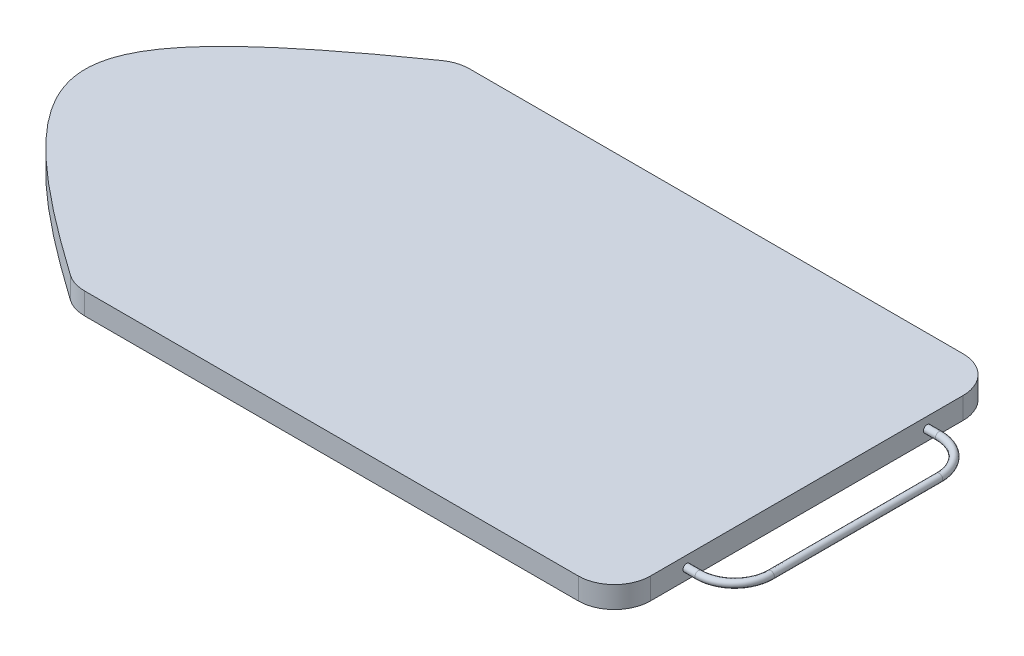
ISO-10303-21;
HEADER;
FILE_DESCRIPTION(('STEP AP214'),'2;1');
FILE_NAME('part.step','',(''),(''),'','','');
FILE_SCHEMA(('AUTOMOTIVE_DESIGN { 1 0 10303 214 1 1 1 1 }'));
ENDSEC;
DATA;
#1=APPLICATION_CONTEXT('core data for automotive mechanical design processes');
#2=APPLICATION_PROTOCOL_DEFINITION('international standard','automotive_design',2000,#1);
#3=PRODUCT_CONTEXT('',#1,'mechanical');
#4=PRODUCT('Part','Part','',(#3));
#5=PRODUCT_RELATED_PRODUCT_CATEGORY('part','',(#4));
#6=PRODUCT_DEFINITION_FORMATION('','',#4);
#7=PRODUCT_DEFINITION_CONTEXT('part definition',#1,'design');
#8=PRODUCT_DEFINITION('design','',#6,#7);
#9=PRODUCT_DEFINITION_SHAPE('','',#8);
#10=(LENGTH_UNIT() NAMED_UNIT(*) SI_UNIT(.MILLI.,.METRE.));
#11=(NAMED_UNIT(*) PLANE_ANGLE_UNIT() SI_UNIT($,.RADIAN.));
#12=(NAMED_UNIT(*) SI_UNIT($,.STERADIAN.) SOLID_ANGLE_UNIT());
#13=UNCERTAINTY_MEASURE_WITH_UNIT(LENGTH_MEASURE(1.E-05),#10,'distance_accuracy_value','');
#14=(GEOMETRIC_REPRESENTATION_CONTEXT(3) GLOBAL_UNCERTAINTY_ASSIGNED_CONTEXT((#13)) GLOBAL_UNIT_ASSIGNED_CONTEXT((#10,
#11,#12)) REPRESENTATION_CONTEXT('',''));
#15=CARTESIAN_POINT('',(0.,0.,0.));
#16=DIRECTION('',(0.,0.,1.));
#17=DIRECTION('',(1.,0.,0.));
#18=AXIS2_PLACEMENT_3D('',#15,#16,#17);
#19=CARTESIAN_POINT('',(-375.,0.,0.));
#20=DIRECTION('',(0.,1.,0.));
#21=DIRECTION('',(0.,0.,1.));
#22=AXIS2_PLACEMENT_3D('',#19,#20,#21);
#23=PLANE('',#22);
#24=DIRECTION('',(-1.,0.,0.));
#25=VECTOR('',#24,1.);
#26=CARTESIAN_POINT('',(-170.030185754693,0.,10.));
#27=LINE('',#26,#25);
#28=CARTESIAN_POINT('',(-128.045256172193,0.,10.));
#29=VERTEX_POINT('',#28);
#30=CARTESIAN_POINT('',(-170.030185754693,0.,10.));
#31=VERTEX_POINT('',#30);
#32=EDGE_CURVE('E420',#29,#31,#27,.T.);
#33=ORIENTED_EDGE('',*,*,#32,.F.);
#34=DIRECTION('',(0.,0.,-1.));
#35=VECTOR('',#34,1.);
#36=CARTESIAN_POINT('',(-128.045256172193,0.,10.));
#37=LINE('',#36,#35);
#38=CARTESIAN_POINT('',(-128.045256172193,0.,-10.));
#39=VERTEX_POINT('',#38);
#40=EDGE_CURVE('E462',#29,#39,#37,.T.);
#41=ORIENTED_EDGE('',*,*,#40,.T.);
#42=DIRECTION('',(-1.,0.,0.));
#43=VECTOR('',#42,1.);
#44=CARTESIAN_POINT('',(-170.030185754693,0.,-10.));
#45=LINE('',#44,#43);
#46=CARTESIAN_POINT('',(-170.030185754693,0.,-10.));
#47=VERTEX_POINT('',#46);
#48=EDGE_CURVE('E441',#39,#47,#45,.T.);
#49=ORIENTED_EDGE('',*,*,#48,.T.);
#50=DIRECTION('',(0.,0.,-1.));
#51=VECTOR('',#50,1.);
#52=CARTESIAN_POINT('',(-170.030185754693,0.,10.));
#53=LINE('',#52,#51);
#54=EDGE_CURVE('E459',#31,#47,#53,.T.);
#55=ORIENTED_EDGE('',*,*,#54,.F.);
#56=EDGE_LOOP('',(#33,#41,#49,#55));
#57=FACE_BOUND('',#56,.T.);
#58=DIRECTION('',(0.,0.,-1.));
#59=VECTOR('',#58,1.);
#60=CARTESIAN_POINT('',(-198.045256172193,0.,10.));
#61=LINE('',#60,#59);
#62=CARTESIAN_POINT('',(-198.045256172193,0.,10.));
#63=VERTEX_POINT('',#62);
#64=CARTESIAN_POINT('',(-198.045256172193,0.,-10.));
#65=VERTEX_POINT('',#64);
#66=EDGE_CURVE('E535',#63,#65,#61,.T.);
#67=ORIENTED_EDGE('',*,*,#66,.T.);
#68=DIRECTION('',(-1.,0.,0.));
#69=VECTOR('',#68,1.);
#70=CARTESIAN_POINT('',(-240.030185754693,0.,-10.));
#71=LINE('',#70,#69);
#72=CARTESIAN_POINT('',(-240.030185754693,0.,-10.));
#73=VERTEX_POINT('',#72);
#74=EDGE_CURVE('E514',#65,#73,#71,.T.);
#75=ORIENTED_EDGE('',*,*,#74,.T.);
#76=DIRECTION('',(0.,0.,-1.));
#77=VECTOR('',#76,1.);
#78=CARTESIAN_POINT('',(-240.030185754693,0.,10.));
#79=LINE('',#78,#77);
#80=CARTESIAN_POINT('',(-240.030185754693,0.,10.));
#81=VERTEX_POINT('',#80);
#82=EDGE_CURVE('E533',#81,#73,#79,.T.);
#83=ORIENTED_EDGE('',*,*,#82,.F.);
#84=DIRECTION('',(-1.,0.,0.));
#85=VECTOR('',#84,1.);
#86=CARTESIAN_POINT('',(-240.030185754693,0.,10.));
#87=LINE('',#86,#85);
#88=EDGE_CURVE('E494',#63,#81,#87,.T.);
#89=ORIENTED_EDGE('',*,*,#88,.F.);
#90=EDGE_LOOP('',(#67,#75,#83,#89));
#91=FACE_BOUND('',#90,.T.);
#92=DIRECTION('',(1.,0.,0.));
#93=VECTOR('',#92,1.);
#94=CARTESIAN_POINT('',(225.,0.,160.));
#95=LINE('',#94,#93);
#96=CARTESIAN_POINT('',(-215.553157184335,0.,160.));
#97=VERTEX_POINT('',#96);
#98=CARTESIAN_POINT('',(195.,0.,160.));
#99=VERTEX_POINT('',#98);
#100=EDGE_CURVE('E683',#97,#99,#95,.T.);
#101=ORIENTED_EDGE('',*,*,#100,.F.);
#102=CARTESIAN_POINT('',(-215.553157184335,0.,130.));
#103=DIRECTION('',(0.,1.,0.));
#104=DIRECTION('',(0.,0.,1.));
#105=AXIS2_PLACEMENT_3D('',#102,#103,#104);
#106=CIRCLE('',#105,30.);
#107=CARTESIAN_POINT('',(-232.801859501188,0.,154.54551422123));
#108=VERTEX_POINT('',#107);
#109=EDGE_CURVE('E646',#97,#108,#106,.F.);
#110=ORIENTED_EDGE('',*,*,#109,.T.);
#111=CARTESIAN_POINT('',(-225.,0.,-160.));
#112=CARTESIAN_POINT('',(-455.,0.,0.));
#113=CARTESIAN_POINT('',(-225.,0.,160.));
#114=(BOUNDED_CURVE() B_SPLINE_CURVE(2,(#111,#112,#113),.UNSPECIFIED.,.F.,
.F.) B_SPLINE_CURVE_WITH_KNOTS((3,3),(0.,1.),
.UNSPECIFIED.) CURVE() GEOMETRIC_REPRESENTATION_ITEM() RATIONAL_B_SPLINE_CURVE((1.,1.875,1.)) REPRESENTATION_ITEM(''));
#115=CARTESIAN_POINT('',(-232.801859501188,0.,-154.54551422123));
#116=VERTEX_POINT('',#115);
#117=EDGE_CURVE('E563',#116,#108,#114,.T.);
#118=ORIENTED_EDGE('',*,*,#117,.F.);
#119=CARTESIAN_POINT('',(-215.553157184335,0.,-130.));
#120=DIRECTION('',(0.,1.,0.));
#121=DIRECTION('',(0.,0.,1.));
#122=AXIS2_PLACEMENT_3D('',#119,#120,#121);
#123=CIRCLE('',#122,30.);
#124=CARTESIAN_POINT('',(-215.553157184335,0.,-160.));
#125=VERTEX_POINT('',#124);
#126=EDGE_CURVE('E643',#116,#125,#123,.F.);
#127=ORIENTED_EDGE('',*,*,#126,.T.);
#128=DIRECTION('',(-1.,0.,0.));
#129=VECTOR('',#128,1.);
#130=CARTESIAN_POINT('',(225.,0.,-160.));
#131=LINE('',#130,#129);
#132=CARTESIAN_POINT('',(195.,0.,-160.));
#133=VERTEX_POINT('',#132);
#134=EDGE_CURVE('E573',#133,#125,#131,.T.);
#135=ORIENTED_EDGE('',*,*,#134,.F.);
#136=CARTESIAN_POINT('',(195.,0.,-130.));
#137=DIRECTION('',(0.,1.,0.));
#138=DIRECTION('',(0.,0.,1.));
#139=AXIS2_PLACEMENT_3D('',#136,#137,#138);
#140=CIRCLE('',#139,30.);
#141=CARTESIAN_POINT('',(225.,0.,-130.));
#142=VERTEX_POINT('',#141);
#143=EDGE_CURVE('E644',#133,#142,#140,.F.);
#144=ORIENTED_EDGE('',*,*,#143,.T.);
#145=DIRECTION('',(0.,0.,-1.));
#146=VECTOR('',#145,1.);
#147=CARTESIAN_POINT('',(225.,0.,160.));
#148=LINE('',#147,#146);
#149=CARTESIAN_POINT('',(225.,0.,130.));
#150=VERTEX_POINT('',#149);
#151=EDGE_CURVE('E685',#150,#142,#148,.T.);
#152=ORIENTED_EDGE('',*,*,#151,.F.);
#153=CARTESIAN_POINT('',(195.,0.,130.));
#154=DIRECTION('',(0.,1.,0.));
#155=DIRECTION('',(0.,0.,1.));
#156=AXIS2_PLACEMENT_3D('',#153,#154,#155);
#157=CIRCLE('',#156,30.);
#158=EDGE_CURVE('E638',#150,#99,#157,.F.);
#159=ORIENTED_EDGE('',*,*,#158,.T.);
#160=EDGE_LOOP('',(#101,#110,#118,#127,#135,#144,#152,#159));
#161=FACE_BOUND('',#160,.T.);
#162=DIRECTION('',(0.,0.,1.));
#163=VECTOR('',#162,1.);
#164=CARTESIAN_POINT('',(165.,0.,-105.));
#165=LINE('',#164,#163);
#166=CARTESIAN_POINT('',(165.,0.,-105.));
#167=VERTEX_POINT('',#166);
#168=CARTESIAN_POINT('',(165.,0.,-90.));
#169=VERTEX_POINT('',#168);
#170=EDGE_CURVE('E63',#167,#169,#165,.T.);
#171=ORIENTED_EDGE('',*,*,#170,.F.);
#172=DIRECTION('',(-1.,0.,0.));
#173=VECTOR('',#172,1.);
#174=CARTESIAN_POINT('',(165.,0.,-105.));
#175=LINE('',#174,#173);
#176=CARTESIAN_POINT('',(125.,0.,-105.));
#177=VERTEX_POINT('',#176);
#178=EDGE_CURVE('E367',#167,#177,#175,.T.);
#179=ORIENTED_EDGE('',*,*,#178,.T.);
#180=DIRECTION('',(0.,0.,1.));
#181=VECTOR('',#180,1.);
#182=CARTESIAN_POINT('',(125.,0.,-105.));
#183=LINE('',#182,#181);
#184=CARTESIAN_POINT('',(125.,0.,-90.));
#185=VERTEX_POINT('',#184);
#186=EDGE_CURVE('E377',#177,#185,#183,.T.);
#187=ORIENTED_EDGE('',*,*,#186,.T.);
#188=DIRECTION('',(-1.,0.,0.));
#189=VECTOR('',#188,1.);
#190=CARTESIAN_POINT('',(165.,0.,-90.));
#191=LINE('',#190,#189);
#192=EDGE_CURVE('E379',#169,#185,#191,.T.);
#193=ORIENTED_EDGE('',*,*,#192,.F.);
#194=EDGE_LOOP('',(#171,#179,#187,#193));
#195=FACE_BOUND('',#194,.T.);
#196=DIRECTION('',(-1.,0.,0.));
#197=VECTOR('',#196,1.);
#198=CARTESIAN_POINT('',(165.,0.,105.));
#199=LINE('',#198,#197);
#200=CARTESIAN_POINT('',(165.,0.,105.));
#201=VERTEX_POINT('',#200);
#202=CARTESIAN_POINT('',(125.,0.,105.));
#203=VERTEX_POINT('',#202);
#204=EDGE_CURVE('E305',#201,#203,#199,.T.);
#205=ORIENTED_EDGE('',*,*,#204,.F.);
#206=DIRECTION('',(0.,0.,-1.));
#207=VECTOR('',#206,1.);
#208=CARTESIAN_POINT('',(165.,0.,105.));
#209=LINE('',#208,#207);
#210=CARTESIAN_POINT('',(165.,0.,90.));
#211=VERTEX_POINT('',#210);
#212=EDGE_CURVE('E315',#201,#211,#209,.T.);
#213=ORIENTED_EDGE('',*,*,#212,.T.);
#214=DIRECTION('',(-1.,0.,0.));
#215=VECTOR('',#214,1.);
#216=CARTESIAN_POINT('',(165.,0.,90.));
#217=LINE('',#216,#215);
#218=CARTESIAN_POINT('',(125.,0.,90.));
#219=VERTEX_POINT('',#218);
#220=EDGE_CURVE('E333',#211,#219,#217,.T.);
#221=ORIENTED_EDGE('',*,*,#220,.T.);
#222=DIRECTION('',(0.,0.,-1.));
#223=VECTOR('',#222,1.);
#224=CARTESIAN_POINT('',(125.,0.,105.));
#225=LINE('',#224,#223);
#226=EDGE_CURVE('E322',#203,#219,#225,.T.);
#227=ORIENTED_EDGE('',*,*,#226,.F.);
#228=EDGE_LOOP('',(#205,#213,#221,#227));
#229=FACE_BOUND('',#228,.T.);
#230=ADVANCED_FACE('F40',(#57,#91,#161,#195,#229),#23,.F.);
#231=CARTESIAN_POINT('',(-225.,18.,-160.));
#232=CARTESIAN_POINT('',(-455.,18.,0.));
#233=CARTESIAN_POINT('',(-225.,18.,160.));
#234=(BOUNDED_CURVE() B_SPLINE_CURVE(2,(#231,#232,#233),.UNSPECIFIED.,.F.,
.F.) B_SPLINE_CURVE_WITH_KNOTS((3,3),(0.,1.),
.UNSPECIFIED.) CURVE() GEOMETRIC_REPRESENTATION_ITEM() RATIONAL_B_SPLINE_CURVE((1.,1.875,1.)) REPRESENTATION_ITEM(''));
#235=DIRECTION('',(0.,-1.,0.));
#236=VECTOR('',#235,1.);
#237=SURFACE_OF_LINEAR_EXTRUSION('',#234,#236);
#238=ORIENTED_EDGE('',*,*,#117,.T.);
#239=DIRECTION('',(0.,-1.,0.));
#240=VECTOR('',#239,1.);
#241=CARTESIAN_POINT('',(-232.801859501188,0.,154.54551422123));
#242=LINE('',#241,#240);
#243=CARTESIAN_POINT('',(-232.801859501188,18.,154.54551422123));
#244=VERTEX_POINT('',#243);
#245=EDGE_CURVE('E656',#108,#244,#242,.F.);
#246=ORIENTED_EDGE('',*,*,#245,.T.);
#247=CARTESIAN_POINT('',(-232.801859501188,18.,-154.54551422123));
#248=VERTEX_POINT('',#247);
#249=EDGE_CURVE('E566',#248,#244,#234,.T.);
#250=ORIENTED_EDGE('',*,*,#249,.F.);
#251=DIRECTION('',(0.,-1.,0.));
#252=VECTOR('',#251,1.);
#253=CARTESIAN_POINT('',(-232.801859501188,18.,-154.54551422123));
#254=LINE('',#253,#252);
#255=EDGE_CURVE('E653',#248,#116,#254,.T.);
#256=ORIENTED_EDGE('',*,*,#255,.T.);
#257=EDGE_LOOP('',(#238,#246,#250,#256));
#258=FACE_BOUND('',#257,.T.);
#259=ADVANCED_FACE('F579',(#258),#237,.F.);
#260=CARTESIAN_POINT('',(225.,18.,160.));
#261=DIRECTION('',(0.,0.,-1.));
#262=DIRECTION('',(-1.,0.,0.));
#263=AXIS2_PLACEMENT_3D('',#260,#261,#262);
#264=PLANE('',#263);
#265=DIRECTION('',(1.,0.,0.));
#266=VECTOR('',#265,1.);
#267=CARTESIAN_POINT('',(225.,18.,160.));
#268=LINE('',#267,#266);
#269=CARTESIAN_POINT('',(-215.553157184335,18.,160.));
#270=VERTEX_POINT('',#269);
#271=CARTESIAN_POINT('',(195.,18.,160.));
#272=VERTEX_POINT('',#271);
#273=EDGE_CURVE('E572',#270,#272,#268,.T.);
#274=ORIENTED_EDGE('',*,*,#273,.F.);
#275=DIRECTION('',(0.,-1.,0.));
#276=VECTOR('',#275,1.);
#277=CARTESIAN_POINT('',(-215.553157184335,18.,160.));
#278=LINE('',#277,#276);
#279=EDGE_CURVE('E648',#270,#97,#278,.T.);
#280=ORIENTED_EDGE('',*,*,#279,.T.);
#281=ORIENTED_EDGE('',*,*,#100,.T.);
#282=DIRECTION('',(0.,-1.,0.));
#283=VECTOR('',#282,1.);
#284=CARTESIAN_POINT('',(195.,18.,160.));
#285=LINE('',#284,#283);
#286=EDGE_CURVE('E639',#99,#272,#285,.F.);
#287=ORIENTED_EDGE('',*,*,#286,.T.);
#288=EDGE_LOOP('',(#274,#280,#281,#287));
#289=FACE_BOUND('',#288,.T.);
#290=ADVANCED_FACE('F583',(#289),#264,.F.);
#291=CARTESIAN_POINT('',(225.,18.,160.));
#292=DIRECTION('',(-1.,0.,0.));
#293=DIRECTION('',(0.,0.,1.));
#294=AXIS2_PLACEMENT_3D('',#291,#292,#293);
#295=PLANE('',#294);
#296=CARTESIAN_POINT('',(225.,9.,-100.));
#297=DIRECTION('',(1.,0.,0.));
#298=DIRECTION('',(0.,0.,-1.));
#299=AXIS2_PLACEMENT_3D('',#296,#297,#298);
#300=CIRCLE('',#299,3.00000000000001);
#301=CARTESIAN_POINT('',(225.,9.,-103.));
#302=VERTEX_POINT('',#301);
#303=EDGE_CURVE('E560',#302,#302,#300,.T.);
#304=ORIENTED_EDGE('',*,*,#303,.F.);
#305=EDGE_LOOP('',(#304));
#306=FACE_BOUND('',#305,.T.);
#307=CARTESIAN_POINT('',(225.,9.,99.9999999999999));
#308=DIRECTION('',(1.,0.,0.));
#309=DIRECTION('',(0.,0.,-1.));
#310=AXIS2_PLACEMENT_3D('',#307,#308,#309);
#311=CIRCLE('',#310,3.00000000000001);
#312=CARTESIAN_POINT('',(225.,9.,96.9999999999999));
#313=VERTEX_POINT('',#312);
#314=EDGE_CURVE('E557',#313,#313,#311,.T.);
#315=ORIENTED_EDGE('',*,*,#314,.F.);
#316=EDGE_LOOP('',(#315));
#317=FACE_BOUND('',#316,.T.);
#318=DIRECTION('',(0.,0.,-1.));
#319=VECTOR('',#318,1.);
#320=CARTESIAN_POINT('',(225.,18.,160.));
#321=LINE('',#320,#319);
#322=CARTESIAN_POINT('',(225.,18.,130.));
#323=VERTEX_POINT('',#322);
#324=CARTESIAN_POINT('',(225.,18.,-130.));
#325=VERTEX_POINT('',#324);
#326=EDGE_CURVE('E628',#323,#325,#321,.T.);
#327=ORIENTED_EDGE('',*,*,#326,.F.);
#328=DIRECTION('',(0.,-1.,0.));
#329=VECTOR('',#328,1.);
#330=CARTESIAN_POINT('',(225.,18.,130.));
#331=LINE('',#330,#329);
#332=EDGE_CURVE('E11',#323,#150,#331,.T.);
#333=ORIENTED_EDGE('',*,*,#332,.T.);
#334=ORIENTED_EDGE('',*,*,#151,.T.);
#335=DIRECTION('',(0.,-1.,0.));
#336=VECTOR('',#335,1.);
#337=CARTESIAN_POINT('',(225.,18.,-130.));
#338=LINE('',#337,#336);
#339=EDGE_CURVE('E48',#142,#325,#338,.F.);
#340=ORIENTED_EDGE('',*,*,#339,.T.);
#341=EDGE_LOOP('',(#327,#333,#334,#340));
#342=FACE_BOUND('',#341,.T.);
#343=ADVANCED_FACE('F614',(#306,#317,#342),#295,.F.);
#344=CARTESIAN_POINT('',(225.,18.,-160.));
#345=DIRECTION('',(0.,0.,1.));
#346=DIRECTION('',(1.,0.,0.));
#347=AXIS2_PLACEMENT_3D('',#344,#345,#346);
#348=PLANE('',#347);
#349=ORIENTED_EDGE('',*,*,#134,.T.);
#350=DIRECTION('',(0.,-1.,0.));
#351=VECTOR('',#350,1.);
#352=CARTESIAN_POINT('',(-215.553157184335,18.,-160.));
#353=LINE('',#352,#351);
#354=CARTESIAN_POINT('',(-215.553157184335,18.,-160.));
#355=VERTEX_POINT('',#354);
#356=EDGE_CURVE('E668',#125,#355,#353,.F.);
#357=ORIENTED_EDGE('',*,*,#356,.T.);
#358=DIRECTION('',(-1.,0.,0.));
#359=VECTOR('',#358,1.);
#360=CARTESIAN_POINT('',(225.,18.,-160.));
#361=LINE('',#360,#359);
#362=CARTESIAN_POINT('',(195.,18.,-160.));
#363=VERTEX_POINT('',#362);
#364=EDGE_CURVE('E635',#363,#355,#361,.T.);
#365=ORIENTED_EDGE('',*,*,#364,.F.);
#366=DIRECTION('',(0.,-1.,0.));
#367=VECTOR('',#366,1.);
#368=CARTESIAN_POINT('',(195.,18.,-160.));
#369=LINE('',#368,#367);
#370=EDGE_CURVE('E665',#363,#133,#369,.T.);
#371=ORIENTED_EDGE('',*,*,#370,.T.);
#372=EDGE_LOOP('',(#349,#357,#365,#371));
#373=FACE_BOUND('',#372,.T.);
#374=ADVANCED_FACE('F612',(#373),#348,.F.);
#375=CARTESIAN_POINT('',(-375.,18.,0.));
#376=DIRECTION('',(0.,1.,0.));
#377=DIRECTION('',(0.,0.,1.));
#378=AXIS2_PLACEMENT_3D('',#375,#376,#377);
#379=PLANE('',#378);
#380=ORIENTED_EDGE('',*,*,#249,.T.);
#381=CARTESIAN_POINT('',(-215.553157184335,18.,130.));
#382=DIRECTION('',(0.,1.,0.));
#383=DIRECTION('',(0.,0.,1.));
#384=AXIS2_PLACEMENT_3D('',#381,#382,#383);
#385=CIRCLE('',#384,30.);
#386=EDGE_CURVE('E663',#244,#270,#385,.T.);
#387=ORIENTED_EDGE('',*,*,#386,.T.);
#388=ORIENTED_EDGE('',*,*,#273,.T.);
#389=CARTESIAN_POINT('',(195.,18.,130.));
#390=DIRECTION('',(0.,1.,0.));
#391=DIRECTION('',(0.,0.,1.));
#392=AXIS2_PLACEMENT_3D('',#389,#390,#391);
#393=CIRCLE('',#392,30.);
#394=EDGE_CURVE('E637',#272,#323,#393,.T.);
#395=ORIENTED_EDGE('',*,*,#394,.T.);
#396=ORIENTED_EDGE('',*,*,#326,.T.);
#397=CARTESIAN_POINT('',(195.,18.,-130.));
#398=DIRECTION('',(0.,1.,0.));
#399=DIRECTION('',(0.,0.,1.));
#400=AXIS2_PLACEMENT_3D('',#397,#398,#399);
#401=CIRCLE('',#400,30.);
#402=EDGE_CURVE('E658',#325,#363,#401,.T.);
#403=ORIENTED_EDGE('',*,*,#402,.T.);
#404=ORIENTED_EDGE('',*,*,#364,.T.);
#405=CARTESIAN_POINT('',(-215.553157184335,18.,-130.));
#406=DIRECTION('',(0.,1.,0.));
#407=DIRECTION('',(0.,0.,1.));
#408=AXIS2_PLACEMENT_3D('',#405,#406,#407);
#409=CIRCLE('',#408,30.);
#410=EDGE_CURVE('E661',#355,#248,#409,.T.);
#411=ORIENTED_EDGE('',*,*,#410,.T.);
#412=EDGE_LOOP('',(#380,#387,#388,#395,#396,#403,#404,#411));
#413=FACE_BOUND('',#412,.T.);
#414=ADVANCED_FACE('F590',(#413),#379,.T.);
#415=CARTESIAN_POINT('',(-215.553157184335,9.,130.));
#416=DIRECTION('',(0.,-1.,0.));
#417=DIRECTION('',(0.,0.,-1.));
#418=AXIS2_PLACEMENT_3D('',#415,#416,#417);
#419=CYLINDRICAL_SURFACE('',#418,30.);
#420=ORIENTED_EDGE('',*,*,#386,.F.);
#421=ORIENTED_EDGE('',*,*,#245,.F.);
#422=ORIENTED_EDGE('',*,*,#109,.F.);
#423=ORIENTED_EDGE('',*,*,#279,.F.);
#424=EDGE_LOOP('',(#420,#421,#422,#423));
#425=FACE_BOUND('',#424,.T.);
#426=ADVANCED_FACE('F586',(#425),#419,.T.);
#427=CARTESIAN_POINT('',(-215.553157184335,9.,-130.));
#428=DIRECTION('',(0.,-1.,0.));
#429=DIRECTION('',(0.,0.,-1.));
#430=AXIS2_PLACEMENT_3D('',#427,#428,#429);
#431=CYLINDRICAL_SURFACE('',#430,30.);
#432=ORIENTED_EDGE('',*,*,#410,.F.);
#433=ORIENTED_EDGE('',*,*,#356,.F.);
#434=ORIENTED_EDGE('',*,*,#126,.F.);
#435=ORIENTED_EDGE('',*,*,#255,.F.);
#436=EDGE_LOOP('',(#432,#433,#434,#435));
#437=FACE_BOUND('',#436,.T.);
#438=ADVANCED_FACE('F589',(#437),#431,.T.);
#439=CARTESIAN_POINT('',(195.,18.,130.));
#440=DIRECTION('',(0.,-1.,0.));
#441=DIRECTION('',(0.,0.,-1.));
#442=AXIS2_PLACEMENT_3D('',#439,#440,#441);
#443=CYLINDRICAL_SURFACE('',#442,30.);
#444=ORIENTED_EDGE('',*,*,#394,.F.);
#445=ORIENTED_EDGE('',*,*,#286,.F.);
#446=ORIENTED_EDGE('',*,*,#158,.F.);
#447=ORIENTED_EDGE('',*,*,#332,.F.);
#448=EDGE_LOOP('',(#444,#445,#446,#447));
#449=FACE_BOUND('',#448,.T.);
#450=ADVANCED_FACE('F593',(#449),#443,.T.);
#451=CARTESIAN_POINT('',(195.,18.,-130.));
#452=DIRECTION('',(0.,-1.,0.));
#453=DIRECTION('',(0.,0.,-1.));
#454=AXIS2_PLACEMENT_3D('',#451,#452,#453);
#455=CYLINDRICAL_SURFACE('',#454,30.);
#456=ORIENTED_EDGE('',*,*,#402,.F.);
#457=ORIENTED_EDGE('',*,*,#339,.F.);
#458=ORIENTED_EDGE('',*,*,#143,.F.);
#459=ORIENTED_EDGE('',*,*,#370,.F.);
#460=EDGE_LOOP('',(#456,#457,#458,#459));
#461=FACE_BOUND('',#460,.T.);
#462=ADVANCED_FACE('F42',(#461),#455,.T.);
#463=CARTESIAN_POINT('',(-215.530185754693,-17.7182227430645,10.));
#464=DIRECTION('',(0.,0.,-1.));
#465=DIRECTION('',(-1.,0.,0.));
#466=AXIS2_PLACEMENT_3D('',#463,#464,#465);
#467=CYLINDRICAL_SURFACE('',#466,9.5);
#468=CARTESIAN_POINT('',(-215.530185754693,-17.7182227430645,-10.));
#469=DIRECTION('',(0.,0.,-1.));
#470=DIRECTION('',(1.,0.,0.));
#471=AXIS2_PLACEMENT_3D('',#468,#469,#470);
#472=CIRCLE('',#471,9.5);
#473=CARTESIAN_POINT('',(-214.372426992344,-27.1474111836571,-10.));
#474=VERTEX_POINT('',#473);
#475=CARTESIAN_POINT('',(-216.687944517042,-8.28903430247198,-10.));
#476=VERTEX_POINT('',#475);
#477=EDGE_CURVE('E506',#474,#476,#472,.T.);
#478=ORIENTED_EDGE('',*,*,#477,.T.);
#479=DIRECTION('',(0.,0.,-1.));
#480=VECTOR('',#479,1.);
#481=CARTESIAN_POINT('',(-216.687944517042,-8.28903430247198,10.));
#482=LINE('',#481,#480);
#483=CARTESIAN_POINT('',(-216.687944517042,-8.28903430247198,10.));
#484=VERTEX_POINT('',#483);
#485=EDGE_CURVE('E541',#484,#476,#482,.T.);
#486=ORIENTED_EDGE('',*,*,#485,.F.);
#487=CARTESIAN_POINT('',(-215.530185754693,-17.7182227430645,10.));
#488=DIRECTION('',(0.,0.,-1.));
#489=DIRECTION('',(1.,0.,0.));
#490=AXIS2_PLACEMENT_3D('',#487,#488,#489);
#491=CIRCLE('',#490,9.5);
#492=CARTESIAN_POINT('',(-214.372426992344,-27.1474111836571,10.));
#493=VERTEX_POINT('',#492);
#494=EDGE_CURVE('E486',#493,#484,#491,.T.);
#495=ORIENTED_EDGE('',*,*,#494,.F.);
#496=DIRECTION('',(0.,0.,-1.));
#497=VECTOR('',#496,1.);
#498=CARTESIAN_POINT('',(-214.372426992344,-27.1474111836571,10.));
#499=LINE('',#498,#497);
#500=EDGE_CURVE('E505',#493,#474,#499,.T.);
#501=ORIENTED_EDGE('',*,*,#500,.T.);
#502=EDGE_LOOP('',(#478,#486,#495,#501));
#503=FACE_BOUND('',#502,.T.);
#504=ADVANCED_FACE('F600',(#503),#467,.F.);
#505=CARTESIAN_POINT('',(-216.687944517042,-8.28903430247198,10.));
#506=DIRECTION('',(-0.121869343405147,0.992546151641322,0.));
#507=DIRECTION('',(-0.992546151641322,-0.121869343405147,0.));
#508=AXIS2_PLACEMENT_3D('',#505,#506,#507);
#509=PLANE('',#508);
#510=DIRECTION('',(0.992546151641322,0.121869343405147,0.));
#511=VECTOR('',#510,1.);
#512=CARTESIAN_POINT('',(-216.687944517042,-8.28903430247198,-10.));
#513=LINE('',#512,#511);
#514=CARTESIAN_POINT('',(-198.045256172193,-6.,-10.));
#515=VERTEX_POINT('',#514);
#516=EDGE_CURVE('E509',#476,#515,#513,.T.);
#517=ORIENTED_EDGE('',*,*,#516,.T.);
#518=DIRECTION('',(0.,0.,-1.));
#519=VECTOR('',#518,1.);
#520=CARTESIAN_POINT('',(-198.045256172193,-6.,10.));
#521=LINE('',#520,#519);
#522=CARTESIAN_POINT('',(-198.045256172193,-6.,10.));
#523=VERTEX_POINT('',#522);
#524=EDGE_CURVE('E538',#523,#515,#521,.T.);
#525=ORIENTED_EDGE('',*,*,#524,.F.);
#526=DIRECTION('',(0.992546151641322,0.121869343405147,0.));
#527=VECTOR('',#526,1.);
#528=CARTESIAN_POINT('',(-216.687944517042,-8.28903430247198,10.));
#529=LINE('',#528,#527);
#530=EDGE_CURVE('E489',#484,#523,#529,.T.);
#531=ORIENTED_EDGE('',*,*,#530,.F.);
#532=ORIENTED_EDGE('',*,*,#485,.T.);
#533=EDGE_LOOP('',(#517,#525,#531,#532));
#534=FACE_BOUND('',#533,.T.);
#535=ADVANCED_FACE('F807',(#534),#509,.F.);
#536=CARTESIAN_POINT('',(-198.045256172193,0.,10.));
#537=DIRECTION('',(-1.,0.,0.));
#538=DIRECTION('',(0.,0.,1.));
#539=AXIS2_PLACEMENT_3D('',#536,#537,#538);
#540=PLANE('',#539);
#541=DIRECTION('',(0.,1.,0.));
#542=VECTOR('',#541,1.);
#543=CARTESIAN_POINT('',(-198.045256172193,0.,-10.));
#544=LINE('',#543,#542);
#545=EDGE_CURVE('E511',#515,#65,#544,.T.);
#546=ORIENTED_EDGE('',*,*,#545,.T.);
#547=ORIENTED_EDGE('',*,*,#66,.F.);
#548=DIRECTION('',(0.,1.,0.));
#549=VECTOR('',#548,1.);
#550=CARTESIAN_POINT('',(-198.045256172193,0.,10.));
#551=LINE('',#550,#549);
#552=EDGE_CURVE('E492',#523,#63,#551,.T.);
#553=ORIENTED_EDGE('',*,*,#552,.F.);
#554=ORIENTED_EDGE('',*,*,#524,.T.);
#555=EDGE_LOOP('',(#546,#547,#553,#554));
#556=FACE_BOUND('',#555,.T.);
#557=ADVANCED_FACE('F803',(#556),#540,.F.);
#558=CARTESIAN_POINT('',(-240.030185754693,-17.7182227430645,10.));
#559=DIRECTION('',(1.,0.,0.));
#560=DIRECTION('',(0.,0.,-1.));
#561=AXIS2_PLACEMENT_3D('',#558,#559,#560);
#562=PLANE('',#561);
#563=DIRECTION('',(0.,-1.,0.));
#564=VECTOR('',#563,1.);
#565=CARTESIAN_POINT('',(-240.030185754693,-17.7182227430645,-10.));
#566=LINE('',#565,#564);
#567=CARTESIAN_POINT('',(-240.030185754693,-17.7182227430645,-10.));
#568=VERTEX_POINT('',#567);
#569=EDGE_CURVE('E517',#73,#568,#566,.T.);
#570=ORIENTED_EDGE('',*,*,#569,.T.);
#571=DIRECTION('',(0.,0.,-1.));
#572=VECTOR('',#571,1.);
#573=CARTESIAN_POINT('',(-240.030185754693,-17.7182227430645,10.));
#574=LINE('',#573,#572);
#575=CARTESIAN_POINT('',(-240.030185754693,-17.7182227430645,10.));
#576=VERTEX_POINT('',#575);
#577=EDGE_CURVE('E530',#576,#568,#574,.T.);
#578=ORIENTED_EDGE('',*,*,#577,.F.);
#579=DIRECTION('',(0.,-1.,0.));
#580=VECTOR('',#579,1.);
#581=CARTESIAN_POINT('',(-240.030185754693,-17.7182227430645,10.));
#582=LINE('',#581,#580);
#583=EDGE_CURVE('E496',#81,#576,#582,.T.);
#584=ORIENTED_EDGE('',*,*,#583,.F.);
#585=ORIENTED_EDGE('',*,*,#82,.T.);
#586=EDGE_LOOP('',(#570,#578,#584,#585));
#587=FACE_BOUND('',#586,.T.);
#588=ADVANCED_FACE('F799',(#587),#562,.F.);
#589=CARTESIAN_POINT('',(-215.530185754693,-17.7182227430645,10.));
#590=DIRECTION('',(0.,0.,-1.));
#591=DIRECTION('',(-1.,0.,0.));
#592=AXIS2_PLACEMENT_3D('',#589,#590,#591);
#593=CYLINDRICAL_SURFACE('',#592,24.5);
#594=CARTESIAN_POINT('',(-215.530185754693,-17.7182227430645,-10.));
#595=DIRECTION('',(0.,0.,1.));
#596=DIRECTION('',(1.,0.,0.));
#597=AXIS2_PLACEMENT_3D('',#594,#595,#596);
#598=CIRCLE('',#597,24.5);
#599=CARTESIAN_POINT('',(-212.544386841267,-42.0356034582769,-10.));
#600=VERTEX_POINT('',#599);
#601=EDGE_CURVE('E519',#568,#600,#598,.T.);
#602=ORIENTED_EDGE('',*,*,#601,.T.);
#603=DIRECTION('',(0.,0.,-1.));
#604=VECTOR('',#603,1.);
#605=CARTESIAN_POINT('',(-212.544386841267,-42.0356034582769,10.));
#606=LINE('',#605,#604);
#607=CARTESIAN_POINT('',(-212.544386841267,-42.0356034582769,10.));
#608=VERTEX_POINT('',#607);
#609=EDGE_CURVE('E527',#608,#600,#606,.T.);
#610=ORIENTED_EDGE('',*,*,#609,.F.);
#611=CARTESIAN_POINT('',(-215.530185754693,-17.7182227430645,10.));
#612=DIRECTION('',(0.,0.,1.));
#613=DIRECTION('',(1.,0.,0.));
#614=AXIS2_PLACEMENT_3D('',#611,#612,#613);
#615=CIRCLE('',#614,24.5);
#616=EDGE_CURVE('E498',#576,#608,#615,.T.);
#617=ORIENTED_EDGE('',*,*,#616,.F.);
#618=ORIENTED_EDGE('',*,*,#577,.T.);
#619=EDGE_LOOP('',(#602,#610,#617,#618));
#620=FACE_BOUND('',#619,.T.);
#621=ADVANCED_FACE('F795',(#620),#593,.T.);
#622=CARTESIAN_POINT('',(-212.544386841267,-42.0356034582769,10.));
#623=DIRECTION('',(-0.121869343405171,0.992546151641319,0.));
#624=DIRECTION('',(-0.992546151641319,-0.121869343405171,0.));
#625=AXIS2_PLACEMENT_3D('',#622,#623,#624);
#626=PLANE('',#625);
#627=DIRECTION('',(0.992546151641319,0.121869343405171,0.));
#628=VECTOR('',#627,1.);
#629=CARTESIAN_POINT('',(-212.544386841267,-42.0356034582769,-10.));
#630=LINE('',#629,#628);
#631=CARTESIAN_POINT('',(-205.100291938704,-41.121583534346,-10.));
#632=VERTEX_POINT('',#631);
#633=EDGE_CURVE('E521',#600,#632,#630,.T.);
#634=ORIENTED_EDGE('',*,*,#633,.T.);
#635=DIRECTION('',(0.,0.,-1.));
#636=VECTOR('',#635,1.);
#637=CARTESIAN_POINT('',(-205.100291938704,-41.121583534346,10.));
#638=LINE('',#637,#636);
#639=CARTESIAN_POINT('',(-205.100291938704,-41.121583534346,10.));
#640=VERTEX_POINT('',#639);
#641=EDGE_CURVE('E548',#632,#640,#638,.F.);
#642=ORIENTED_EDGE('',*,*,#641,.T.);
#643=DIRECTION('',(0.992546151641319,0.121869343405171,0.));
#644=VECTOR('',#643,1.);
#645=CARTESIAN_POINT('',(-212.544386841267,-42.0356034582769,10.));
#646=LINE('',#645,#644);
#647=EDGE_CURVE('E500',#608,#640,#646,.T.);
#648=ORIENTED_EDGE('',*,*,#647,.F.);
#649=ORIENTED_EDGE('',*,*,#609,.T.);
#650=EDGE_LOOP('',(#634,#642,#648,#649));
#651=FACE_BOUND('',#650,.T.);
#652=ADVANCED_FACE('F791',(#651),#626,.F.);
#653=CARTESIAN_POINT('',(-214.372426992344,-27.1474111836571,10.));
#654=DIRECTION('',(0.121869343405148,-0.992546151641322,0.));
#655=DIRECTION('',(0.992546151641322,0.121869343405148,0.));
#656=AXIS2_PLACEMENT_3D('',#653,#654,#655);
#657=PLANE('',#656);
#658=DIRECTION('',(-0.992546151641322,-0.121869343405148,0.));
#659=VECTOR('',#658,1.);
#660=CARTESIAN_POINT('',(-214.372426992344,-27.1474111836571,10.));
#661=LINE('',#660,#659);
#662=CARTESIAN_POINT('',(-206.928332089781,-26.2333912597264,10.));
#663=VERTEX_POINT('',#662);
#664=EDGE_CURVE('E503',#663,#493,#661,.T.);
#665=ORIENTED_EDGE('',*,*,#664,.F.);
#666=DIRECTION('',(0.,0.,-1.));
#667=VECTOR('',#666,1.);
#668=CARTESIAN_POINT('',(-206.928332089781,-26.2333912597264,10.));
#669=LINE('',#668,#667);
#670=CARTESIAN_POINT('',(-206.928332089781,-26.2333912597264,-10.));
#671=VERTEX_POINT('',#670);
#672=EDGE_CURVE('E555',#663,#671,#669,.T.);
#673=ORIENTED_EDGE('',*,*,#672,.T.);
#674=DIRECTION('',(-0.992546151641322,-0.121869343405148,0.));
#675=VECTOR('',#674,1.);
#676=CARTESIAN_POINT('',(-214.372426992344,-27.1474111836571,-10.));
#677=LINE('',#676,#675);
#678=EDGE_CURVE('E490',#671,#474,#677,.T.);
#679=ORIENTED_EDGE('',*,*,#678,.T.);
#680=ORIENTED_EDGE('',*,*,#500,.F.);
#681=EDGE_LOOP('',(#665,#673,#679,#680));
#682=FACE_BOUND('',#681,.T.);
#683=ADVANCED_FACE('F783',(#682),#657,.F.);
#684=CARTESIAN_POINT('',(-215.530185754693,-17.7182227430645,10.));
#685=DIRECTION('',(0.,0.,1.));
#686=DIRECTION('',(1.,0.,0.));
#687=AXIS2_PLACEMENT_3D('',#684,#685,#686);
#688=PLANE('',#687);
#689=ORIENTED_EDGE('',*,*,#647,.T.);
#690=CARTESIAN_POINT('',(-206.014312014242,-33.6774873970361,10.));
#691=DIRECTION('',(0.,0.,1.));
#692=DIRECTION('',(1.,0.,0.));
#693=AXIS2_PLACEMENT_3D('',#690,#691,#692);
#694=CIRCLE('',#693,7.5);
#695=CARTESIAN_POINT('',(-198.570215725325,-32.7634685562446,10.));
#696=VERTEX_POINT('',#695);
#697=EDGE_CURVE('E553',#640,#696,#694,.T.);
#698=ORIENTED_EDGE('',*,*,#697,.T.);
#699=CARTESIAN_POINT('',(-206.014312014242,-33.6774873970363,10.));
#700=DIRECTION('',(0.,0.,1.));
#701=DIRECTION('',(1.,0.,0.));
#702=AXIS2_PLACEMENT_3D('',#699,#700,#701);
#703=CIRCLE('',#702,7.5);
#704=EDGE_CURVE('E551',#696,#663,#703,.T.);
#705=ORIENTED_EDGE('',*,*,#704,.T.);
#706=ORIENTED_EDGE('',*,*,#664,.T.);
#707=ORIENTED_EDGE('',*,*,#494,.T.);
#708=ORIENTED_EDGE('',*,*,#530,.T.);
#709=ORIENTED_EDGE('',*,*,#552,.T.);
#710=ORIENTED_EDGE('',*,*,#88,.T.);
#711=ORIENTED_EDGE('',*,*,#583,.T.);
#712=ORIENTED_EDGE('',*,*,#616,.T.);
#713=EDGE_LOOP('',(#689,#698,#705,#706,#707,#708,#709,#710,#711,#712));
#714=FACE_BOUND('',#713,.T.);
#715=ADVANCED_FACE('F779',(#714),#688,.T.);
#716=CARTESIAN_POINT('',(-215.530185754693,-17.7182227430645,-10.));
#717=DIRECTION('',(0.,0.,1.));
#718=DIRECTION('',(1.,0.,0.));
#719=AXIS2_PLACEMENT_3D('',#716,#717,#718);
#720=PLANE('',#719);
#721=CARTESIAN_POINT('',(-206.014312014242,-33.6774873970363,-10.));
#722=DIRECTION('',(0.,0.,1.));
#723=DIRECTION('',(1.,0.,0.));
#724=AXIS2_PLACEMENT_3D('',#721,#722,#723);
#725=CIRCLE('',#724,7.5);
#726=CARTESIAN_POINT('',(-198.570215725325,-32.7634685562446,-10.));
#727=VERTEX_POINT('',#726);
#728=EDGE_CURVE('E544',#671,#727,#725,.F.);
#729=ORIENTED_EDGE('',*,*,#728,.T.);
#730=CARTESIAN_POINT('',(-206.014312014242,-33.6774873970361,-10.));
#731=DIRECTION('',(0.,0.,1.));
#732=DIRECTION('',(1.,0.,0.));
#733=AXIS2_PLACEMENT_3D('',#730,#731,#732);
#734=CIRCLE('',#733,7.5);
#735=EDGE_CURVE('E546',#727,#632,#734,.F.);
#736=ORIENTED_EDGE('',*,*,#735,.T.);
#737=ORIENTED_EDGE('',*,*,#633,.F.);
#738=ORIENTED_EDGE('',*,*,#601,.F.);
#739=ORIENTED_EDGE('',*,*,#569,.F.);
#740=ORIENTED_EDGE('',*,*,#74,.F.);
#741=ORIENTED_EDGE('',*,*,#545,.F.);
#742=ORIENTED_EDGE('',*,*,#516,.F.);
#743=ORIENTED_EDGE('',*,*,#477,.F.);
#744=ORIENTED_EDGE('',*,*,#678,.F.);
#745=EDGE_LOOP('',(#729,#736,#737,#738,#739,#740,#741,#742,#743,#744));
#746=FACE_BOUND('',#745,.T.);
#747=ADVANCED_FACE('F782',(#746),#720,.F.);
#748=CARTESIAN_POINT('',(-206.014312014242,-33.6774873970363,10.));
#749=DIRECTION('',(0.,0.,-1.));
#750=DIRECTION('',(-1.,0.,0.));
#751=AXIS2_PLACEMENT_3D('',#748,#749,#750);
#752=CYLINDRICAL_SURFACE('',#751,7.5);
#753=ORIENTED_EDGE('',*,*,#672,.F.);
#754=ORIENTED_EDGE('',*,*,#704,.F.);
#755=DIRECTION('',(0.,0.,-1.));
#756=VECTOR('',#755,1.);
#757=CARTESIAN_POINT('',(-198.570215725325,-32.7634685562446,10.));
#758=LINE('',#757,#756);
#759=EDGE_CURVE('E483',#727,#696,#758,.F.);
#760=ORIENTED_EDGE('',*,*,#759,.F.);
#761=ORIENTED_EDGE('',*,*,#728,.F.);
#762=EDGE_LOOP('',(#753,#754,#760,#761));
#763=FACE_BOUND('',#762,.T.);
#764=ADVANCED_FACE('F787',(#763),#752,.T.);
#765=CARTESIAN_POINT('',(-206.014312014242,-33.6774873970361,10.));
#766=DIRECTION('',(0.,0.,-1.));
#767=DIRECTION('',(-1.,0.,0.));
#768=AXIS2_PLACEMENT_3D('',#765,#766,#767);
#769=CYLINDRICAL_SURFACE('',#768,7.5);
#770=ORIENTED_EDGE('',*,*,#697,.F.);
#771=ORIENTED_EDGE('',*,*,#641,.F.);
#772=ORIENTED_EDGE('',*,*,#735,.F.);
#773=ORIENTED_EDGE('',*,*,#759,.T.);
#774=EDGE_LOOP('',(#770,#771,#772,#773));
#775=FACE_BOUND('',#774,.T.);
#776=ADVANCED_FACE('F770',(#775),#769,.T.);
#777=CARTESIAN_POINT('',(-145.530185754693,-17.7182227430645,10.));
#778=DIRECTION('',(0.,0.,-1.));
#779=DIRECTION('',(-1.,0.,0.));
#780=AXIS2_PLACEMENT_3D('',#777,#778,#779);
#781=CYLINDRICAL_SURFACE('',#780,9.5);
#782=CARTESIAN_POINT('',(-145.530185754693,-17.7182227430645,-10.));
#783=DIRECTION('',(0.,0.,-1.));
#784=DIRECTION('',(1.,0.,0.));
#785=AXIS2_PLACEMENT_3D('',#782,#783,#784);
#786=CIRCLE('',#785,9.5);
#787=CARTESIAN_POINT('',(-144.372426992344,-27.1474111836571,-10.));
#788=VERTEX_POINT('',#787);
#789=CARTESIAN_POINT('',(-146.687944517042,-8.28903430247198,-10.));
#790=VERTEX_POINT('',#789);
#791=EDGE_CURVE('E433',#788,#790,#786,.T.);
#792=ORIENTED_EDGE('',*,*,#791,.T.);
#793=DIRECTION('',(0.,0.,-1.));
#794=VECTOR('',#793,1.);
#795=CARTESIAN_POINT('',(-146.687944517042,-8.28903430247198,10.));
#796=LINE('',#795,#794);
#797=CARTESIAN_POINT('',(-146.687944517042,-8.28903430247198,10.));
#798=VERTEX_POINT('',#797);
#799=EDGE_CURVE('E467',#798,#790,#796,.T.);
#800=ORIENTED_EDGE('',*,*,#799,.F.);
#801=CARTESIAN_POINT('',(-145.530185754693,-17.7182227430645,10.));
#802=DIRECTION('',(0.,0.,-1.));
#803=DIRECTION('',(1.,0.,0.));
#804=AXIS2_PLACEMENT_3D('',#801,#802,#803);
#805=CIRCLE('',#804,9.5);
#806=CARTESIAN_POINT('',(-144.372426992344,-27.1474111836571,10.));
#807=VERTEX_POINT('',#806);
#808=EDGE_CURVE('E411',#807,#798,#805,.T.);
#809=ORIENTED_EDGE('',*,*,#808,.F.);
#810=DIRECTION('',(0.,0.,-1.));
#811=VECTOR('',#810,1.);
#812=CARTESIAN_POINT('',(-144.372426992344,-27.1474111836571,10.));
#813=LINE('',#812,#811);
#814=EDGE_CURVE('E432',#807,#788,#813,.T.);
#815=ORIENTED_EDGE('',*,*,#814,.T.);
#816=EDGE_LOOP('',(#792,#800,#809,#815));
#817=FACE_BOUND('',#816,.T.);
#818=ADVANCED_FACE('F766',(#817),#781,.F.);
#819=CARTESIAN_POINT('',(-146.687944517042,-8.28903430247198,10.));
#820=DIRECTION('',(-0.121869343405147,0.992546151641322,0.));
#821=DIRECTION('',(-0.992546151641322,-0.121869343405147,0.));
#822=AXIS2_PLACEMENT_3D('',#819,#820,#821);
#823=PLANE('',#822);
#824=DIRECTION('',(0.992546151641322,0.121869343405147,0.));
#825=VECTOR('',#824,1.);
#826=CARTESIAN_POINT('',(-146.687944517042,-8.28903430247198,-10.));
#827=LINE('',#826,#825);
#828=CARTESIAN_POINT('',(-128.045256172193,-6.,-10.));
#829=VERTEX_POINT('',#828);
#830=EDGE_CURVE('E436',#790,#829,#827,.T.);
#831=ORIENTED_EDGE('',*,*,#830,.T.);
#832=DIRECTION('',(0.,0.,-1.));
#833=VECTOR('',#832,1.);
#834=CARTESIAN_POINT('',(-128.045256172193,-6.,10.));
#835=LINE('',#834,#833);
#836=CARTESIAN_POINT('',(-128.045256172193,-6.,10.));
#837=VERTEX_POINT('',#836);
#838=EDGE_CURVE('E464',#837,#829,#835,.T.);
#839=ORIENTED_EDGE('',*,*,#838,.F.);
#840=DIRECTION('',(0.992546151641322,0.121869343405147,0.));
#841=VECTOR('',#840,1.);
#842=CARTESIAN_POINT('',(-146.687944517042,-8.28903430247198,10.));
#843=LINE('',#842,#841);
#844=EDGE_CURVE('E414',#798,#837,#843,.T.);
#845=ORIENTED_EDGE('',*,*,#844,.F.);
#846=ORIENTED_EDGE('',*,*,#799,.T.);
#847=EDGE_LOOP('',(#831,#839,#845,#846));
#848=FACE_BOUND('',#847,.T.);
#849=ADVANCED_FACE('F762',(#848),#823,.F.);
#850=CARTESIAN_POINT('',(-128.045256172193,0.,10.));
#851=DIRECTION('',(-1.,0.,0.));
#852=DIRECTION('',(0.,0.,1.));
#853=AXIS2_PLACEMENT_3D('',#850,#851,#852);
#854=PLANE('',#853);
#855=DIRECTION('',(0.,1.,0.));
#856=VECTOR('',#855,1.);
#857=CARTESIAN_POINT('',(-128.045256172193,0.,-10.));
#858=LINE('',#857,#856);
#859=EDGE_CURVE('E438',#829,#39,#858,.T.);
#860=ORIENTED_EDGE('',*,*,#859,.T.);
#861=ORIENTED_EDGE('',*,*,#40,.F.);
#862=DIRECTION('',(0.,1.,0.));
#863=VECTOR('',#862,1.);
#864=CARTESIAN_POINT('',(-128.045256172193,0.,10.));
#865=LINE('',#864,#863);
#866=EDGE_CURVE('E417',#837,#29,#865,.T.);
#867=ORIENTED_EDGE('',*,*,#866,.F.);
#868=ORIENTED_EDGE('',*,*,#838,.T.);
#869=EDGE_LOOP('',(#860,#861,#867,#868));
#870=FACE_BOUND('',#869,.T.);
#871=ADVANCED_FACE('F758',(#870),#854,.F.);
#872=CARTESIAN_POINT('',(-170.030185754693,-17.7182227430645,10.));
#873=DIRECTION('',(1.,0.,0.));
#874=DIRECTION('',(0.,0.,-1.));
#875=AXIS2_PLACEMENT_3D('',#872,#873,#874);
#876=PLANE('',#875);
#877=DIRECTION('',(0.,-1.,0.));
#878=VECTOR('',#877,1.);
#879=CARTESIAN_POINT('',(-170.030185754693,-17.7182227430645,-10.));
#880=LINE('',#879,#878);
#881=CARTESIAN_POINT('',(-170.030185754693,-17.7182227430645,-10.));
#882=VERTEX_POINT('',#881);
#883=EDGE_CURVE('E443',#47,#882,#880,.T.);
#884=ORIENTED_EDGE('',*,*,#883,.T.);
#885=DIRECTION('',(0.,0.,-1.));
#886=VECTOR('',#885,1.);
#887=CARTESIAN_POINT('',(-170.030185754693,-17.7182227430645,10.));
#888=LINE('',#887,#886);
#889=CARTESIAN_POINT('',(-170.030185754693,-17.7182227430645,10.));
#890=VERTEX_POINT('',#889);
#891=EDGE_CURVE('E456',#890,#882,#888,.T.);
#892=ORIENTED_EDGE('',*,*,#891,.F.);
#893=DIRECTION('',(0.,-1.,0.));
#894=VECTOR('',#893,1.);
#895=CARTESIAN_POINT('',(-170.030185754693,-17.7182227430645,10.));
#896=LINE('',#895,#894);
#897=EDGE_CURVE('E423',#31,#890,#896,.T.);
#898=ORIENTED_EDGE('',*,*,#897,.F.);
#899=ORIENTED_EDGE('',*,*,#54,.T.);
#900=EDGE_LOOP('',(#884,#892,#898,#899));
#901=FACE_BOUND('',#900,.T.);
#902=ADVANCED_FACE('F754',(#901),#876,.F.);
#903=CARTESIAN_POINT('',(-145.530185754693,-17.7182227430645,10.));
#904=DIRECTION('',(0.,0.,-1.));
#905=DIRECTION('',(-1.,0.,0.));
#906=AXIS2_PLACEMENT_3D('',#903,#904,#905);
#907=CYLINDRICAL_SURFACE('',#906,24.5);
#908=CARTESIAN_POINT('',(-145.530185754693,-17.7182227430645,-10.));
#909=DIRECTION('',(0.,0.,1.));
#910=DIRECTION('',(1.,0.,0.));
#911=AXIS2_PLACEMENT_3D('',#908,#909,#910);
#912=CIRCLE('',#911,24.5);
#913=CARTESIAN_POINT('',(-142.544386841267,-42.0356034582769,-10.));
#914=VERTEX_POINT('',#913);
#915=EDGE_CURVE('E445',#882,#914,#912,.T.);
#916=ORIENTED_EDGE('',*,*,#915,.T.);
#917=DIRECTION('',(0.,0.,-1.));
#918=VECTOR('',#917,1.);
#919=CARTESIAN_POINT('',(-142.544386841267,-42.0356034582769,10.));
#920=LINE('',#919,#918);
#921=CARTESIAN_POINT('',(-142.544386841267,-42.0356034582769,10.));
#922=VERTEX_POINT('',#921);
#923=EDGE_CURVE('E453',#922,#914,#920,.T.);
#924=ORIENTED_EDGE('',*,*,#923,.F.);
#925=CARTESIAN_POINT('',(-145.530185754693,-17.7182227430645,10.));
#926=DIRECTION('',(0.,0.,1.));
#927=DIRECTION('',(1.,0.,0.));
#928=AXIS2_PLACEMENT_3D('',#925,#926,#927);
#929=CIRCLE('',#928,24.5);
#930=EDGE_CURVE('E425',#890,#922,#929,.T.);
#931=ORIENTED_EDGE('',*,*,#930,.F.);
#932=ORIENTED_EDGE('',*,*,#891,.T.);
#933=EDGE_LOOP('',(#916,#924,#931,#932));
#934=FACE_BOUND('',#933,.T.);
#935=ADVANCED_FACE('F750',(#934),#907,.T.);
#936=CARTESIAN_POINT('',(-142.544386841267,-42.0356034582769,10.));
#937=DIRECTION('',(-0.121869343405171,0.992546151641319,0.));
#938=DIRECTION('',(-0.992546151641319,-0.121869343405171,0.));
#939=AXIS2_PLACEMENT_3D('',#936,#937,#938);
#940=PLANE('',#939);
#941=DIRECTION('',(0.992546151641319,0.121869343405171,0.));
#942=VECTOR('',#941,1.);
#943=CARTESIAN_POINT('',(-142.544386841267,-42.0356034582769,-10.));
#944=LINE('',#943,#942);
#945=CARTESIAN_POINT('',(-135.100291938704,-41.121583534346,-10.));
#946=VERTEX_POINT('',#945);
#947=EDGE_CURVE('E447',#914,#946,#944,.T.);
#948=ORIENTED_EDGE('',*,*,#947,.T.);
#949=DIRECTION('',(0.,0.,-1.));
#950=VECTOR('',#949,1.);
#951=CARTESIAN_POINT('',(-135.100291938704,-41.121583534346,10.));
#952=LINE('',#951,#950);
#953=CARTESIAN_POINT('',(-135.100291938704,-41.121583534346,10.));
#954=VERTEX_POINT('',#953);
#955=EDGE_CURVE('E474',#946,#954,#952,.F.);
#956=ORIENTED_EDGE('',*,*,#955,.T.);
#957=DIRECTION('',(0.992546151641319,0.121869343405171,0.));
#958=VECTOR('',#957,1.);
#959=CARTESIAN_POINT('',(-142.544386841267,-42.0356034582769,10.));
#960=LINE('',#959,#958);
#961=EDGE_CURVE('E427',#922,#954,#960,.T.);
#962=ORIENTED_EDGE('',*,*,#961,.F.);
#963=ORIENTED_EDGE('',*,*,#923,.T.);
#964=EDGE_LOOP('',(#948,#956,#962,#963));
#965=FACE_BOUND('',#964,.T.);
#966=ADVANCED_FACE('F746',(#965),#940,.F.);
#967=CARTESIAN_POINT('',(-144.372426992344,-27.1474111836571,10.));
#968=DIRECTION('',(0.121869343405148,-0.992546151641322,0.));
#969=DIRECTION('',(0.992546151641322,0.121869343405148,0.));
#970=AXIS2_PLACEMENT_3D('',#967,#968,#969);
#971=PLANE('',#970);
#972=DIRECTION('',(-0.992546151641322,-0.121869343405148,0.));
#973=VECTOR('',#972,1.);
#974=CARTESIAN_POINT('',(-144.372426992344,-27.1474111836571,10.));
#975=LINE('',#974,#973);
#976=CARTESIAN_POINT('',(-136.928332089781,-26.2333912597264,10.));
#977=VERTEX_POINT('',#976);
#978=EDGE_CURVE('E430',#977,#807,#975,.T.);
#979=ORIENTED_EDGE('',*,*,#978,.F.);
#980=DIRECTION('',(0.,0.,-1.));
#981=VECTOR('',#980,1.);
#982=CARTESIAN_POINT('',(-136.928332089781,-26.2333912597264,10.));
#983=LINE('',#982,#981);
#984=CARTESIAN_POINT('',(-136.928332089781,-26.2333912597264,-10.));
#985=VERTEX_POINT('',#984);
#986=EDGE_CURVE('E481',#977,#985,#983,.T.);
#987=ORIENTED_EDGE('',*,*,#986,.T.);
#988=DIRECTION('',(-0.992546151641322,-0.121869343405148,0.));
#989=VECTOR('',#988,1.);
#990=CARTESIAN_POINT('',(-144.372426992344,-27.1474111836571,-10.));
#991=LINE('',#990,#989);
#992=EDGE_CURVE('E415',#985,#788,#991,.T.);
#993=ORIENTED_EDGE('',*,*,#992,.T.);
#994=ORIENTED_EDGE('',*,*,#814,.F.);
#995=EDGE_LOOP('',(#979,#987,#993,#994));
#996=FACE_BOUND('',#995,.T.);
#997=ADVANCED_FACE('F738',(#996),#971,.F.);
#998=CARTESIAN_POINT('',(-145.530185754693,-17.7182227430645,10.));
#999=DIRECTION('',(0.,0.,1.));
#1000=DIRECTION('',(1.,0.,0.));
#1001=AXIS2_PLACEMENT_3D('',#998,#999,#1000);
#1002=PLANE('',#1001);
#1003=ORIENTED_EDGE('',*,*,#961,.T.);
#1004=CARTESIAN_POINT('',(-136.014312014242,-33.6774873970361,10.));
#1005=DIRECTION('',(0.,0.,1.));
#1006=DIRECTION('',(1.,0.,0.));
#1007=AXIS2_PLACEMENT_3D('',#1004,#1005,#1006);
#1008=CIRCLE('',#1007,7.5);
#1009=CARTESIAN_POINT('',(-128.570215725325,-32.7634685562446,10.));
#1010=VERTEX_POINT('',#1009);
#1011=EDGE_CURVE('E479',#954,#1010,#1008,.T.);
#1012=ORIENTED_EDGE('',*,*,#1011,.T.);
#1013=CARTESIAN_POINT('',(-136.014312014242,-33.6774873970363,10.));
#1014=DIRECTION('',(0.,0.,1.));
#1015=DIRECTION('',(1.,0.,0.));
#1016=AXIS2_PLACEMENT_3D('',#1013,#1014,#1015);
#1017=CIRCLE('',#1016,7.5);
#1018=EDGE_CURVE('E477',#1010,#977,#1017,.T.);
#1019=ORIENTED_EDGE('',*,*,#1018,.T.);
#1020=ORIENTED_EDGE('',*,*,#978,.T.);
#1021=ORIENTED_EDGE('',*,*,#808,.T.);
#1022=ORIENTED_EDGE('',*,*,#844,.T.);
#1023=ORIENTED_EDGE('',*,*,#866,.T.);
#1024=ORIENTED_EDGE('',*,*,#32,.T.);
#1025=ORIENTED_EDGE('',*,*,#897,.T.);
#1026=ORIENTED_EDGE('',*,*,#930,.T.);
#1027=EDGE_LOOP('',(#1003,#1012,#1019,#1020,#1021,#1022,#1023,#1024,#1025,#1026));
#1028=FACE_BOUND('',#1027,.T.);
#1029=ADVANCED_FACE('F734',(#1028),#1002,.T.);
#1030=CARTESIAN_POINT('',(-145.530185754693,-17.7182227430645,-10.));
#1031=DIRECTION('',(0.,0.,1.));
#1032=DIRECTION('',(1.,0.,0.));
#1033=AXIS2_PLACEMENT_3D('',#1030,#1031,#1032);
#1034=PLANE('',#1033);
#1035=CARTESIAN_POINT('',(-136.014312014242,-33.6774873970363,-10.));
#1036=DIRECTION('',(0.,0.,1.));
#1037=DIRECTION('',(1.,0.,0.));
#1038=AXIS2_PLACEMENT_3D('',#1035,#1036,#1037);
#1039=CIRCLE('',#1038,7.5);
#1040=CARTESIAN_POINT('',(-128.570215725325,-32.7634685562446,-10.));
#1041=VERTEX_POINT('',#1040);
#1042=EDGE_CURVE('E470',#985,#1041,#1039,.F.);
#1043=ORIENTED_EDGE('',*,*,#1042,.T.);
#1044=CARTESIAN_POINT('',(-136.014312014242,-33.6774873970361,-10.));
#1045=DIRECTION('',(0.,0.,1.));
#1046=DIRECTION('',(1.,0.,0.));
#1047=AXIS2_PLACEMENT_3D('',#1044,#1045,#1046);
#1048=CIRCLE('',#1047,7.5);
#1049=EDGE_CURVE('E472',#1041,#946,#1048,.F.);
#1050=ORIENTED_EDGE('',*,*,#1049,.T.);
#1051=ORIENTED_EDGE('',*,*,#947,.F.);
#1052=ORIENTED_EDGE('',*,*,#915,.F.);
#1053=ORIENTED_EDGE('',*,*,#883,.F.);
#1054=ORIENTED_EDGE('',*,*,#48,.F.);
#1055=ORIENTED_EDGE('',*,*,#859,.F.);
#1056=ORIENTED_EDGE('',*,*,#830,.F.);
#1057=ORIENTED_EDGE('',*,*,#791,.F.);
#1058=ORIENTED_EDGE('',*,*,#992,.F.);
#1059=EDGE_LOOP('',(#1043,#1050,#1051,#1052,#1053,#1054,#1055,#1056,#1057,#1058));
#1060=FACE_BOUND('',#1059,.T.);
#1061=ADVANCED_FACE('F737',(#1060),#1034,.F.);
#1062=CARTESIAN_POINT('',(-136.014312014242,-33.6774873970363,10.));
#1063=DIRECTION('',(0.,0.,-1.));
#1064=DIRECTION('',(-1.,0.,0.));
#1065=AXIS2_PLACEMENT_3D('',#1062,#1063,#1064);
#1066=CYLINDRICAL_SURFACE('',#1065,7.5);
#1067=ORIENTED_EDGE('',*,*,#986,.F.);
#1068=ORIENTED_EDGE('',*,*,#1018,.F.);
#1069=DIRECTION('',(0.,0.,-1.));
#1070=VECTOR('',#1069,1.);
#1071=CARTESIAN_POINT('',(-128.570215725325,-32.7634685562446,10.));
#1072=LINE('',#1071,#1070);
#1073=EDGE_CURVE('E410',#1041,#1010,#1072,.F.);
#1074=ORIENTED_EDGE('',*,*,#1073,.F.);
#1075=ORIENTED_EDGE('',*,*,#1042,.F.);
#1076=EDGE_LOOP('',(#1067,#1068,#1074,#1075));
#1077=FACE_BOUND('',#1076,.T.);
#1078=ADVANCED_FACE('F742',(#1077),#1066,.T.);
#1079=CARTESIAN_POINT('',(-136.014312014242,-33.6774873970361,10.));
#1080=DIRECTION('',(0.,0.,-1.));
#1081=DIRECTION('',(-1.,0.,0.));
#1082=AXIS2_PLACEMENT_3D('',#1079,#1080,#1081);
#1083=CYLINDRICAL_SURFACE('',#1082,7.5);
#1084=ORIENTED_EDGE('',*,*,#1011,.F.);
#1085=ORIENTED_EDGE('',*,*,#955,.F.);
#1086=ORIENTED_EDGE('',*,*,#1049,.F.);
#1087=ORIENTED_EDGE('',*,*,#1073,.T.);
#1088=EDGE_LOOP('',(#1084,#1085,#1086,#1087));
#1089=FACE_BOUND('',#1088,.T.);
#1090=ADVANCED_FACE('F772',(#1089),#1083,.T.);
#1091=CARTESIAN_POINT('',(165.,0.,-105.));
#1092=DIRECTION('',(-1.,0.,0.));
#1093=DIRECTION('',(0.,-1.,0.));
#1094=AXIS2_PLACEMENT_3D('',#1091,#1092,#1093);
#1095=PLANE('',#1094);
#1096=DIRECTION('',(0.,1.,0.));
#1097=VECTOR('',#1096,1.);
#1098=CARTESIAN_POINT('',(165.,0.,-105.));
#1099=LINE('',#1098,#1097);
#1100=CARTESIAN_POINT('',(165.,-25.,-105.));
#1101=VERTEX_POINT('',#1100);
#1102=EDGE_CURVE('E365',#1101,#167,#1099,.T.);
#1103=ORIENTED_EDGE('',*,*,#1102,.T.);
#1104=ORIENTED_EDGE('',*,*,#170,.T.);
#1105=DIRECTION('',(0.,1.,0.));
#1106=VECTOR('',#1105,1.);
#1107=CARTESIAN_POINT('',(165.,0.,-90.));
#1108=LINE('',#1107,#1106);
#1109=CARTESIAN_POINT('',(165.,-25.,-90.));
#1110=VERTEX_POINT('',#1109);
#1111=EDGE_CURVE('E364',#1110,#169,#1108,.T.);
#1112=ORIENTED_EDGE('',*,*,#1111,.F.);
#1113=DIRECTION('',(0.,0.,1.));
#1114=VECTOR('',#1113,1.);
#1115=CARTESIAN_POINT('',(165.,-25.,-105.));
#1116=LINE('',#1115,#1114);
#1117=EDGE_CURVE('E390',#1101,#1110,#1116,.T.);
#1118=ORIENTED_EDGE('',*,*,#1117,.F.);
#1119=EDGE_LOOP('',(#1103,#1104,#1112,#1118));
#1120=FACE_BOUND('',#1119,.T.);
#1121=ADVANCED_FACE('F705',(#1120),#1095,.F.);
#1122=CARTESIAN_POINT('',(125.,0.,-105.));
#1123=DIRECTION('',(1.,0.,0.));
#1124=DIRECTION('',(0.,0.,1.));
#1125=AXIS2_PLACEMENT_3D('',#1122,#1123,#1124);
#1126=PLANE('',#1125);
#1127=DIRECTION('',(0.,-1.,0.));
#1128=VECTOR('',#1127,1.);
#1129=CARTESIAN_POINT('',(125.,0.,-90.));
#1130=LINE('',#1129,#1128);
#1131=CARTESIAN_POINT('',(125.,-25.,-90.));
#1132=VERTEX_POINT('',#1131);
#1133=EDGE_CURVE('E382',#185,#1132,#1130,.T.);
#1134=ORIENTED_EDGE('',*,*,#1133,.F.);
#1135=ORIENTED_EDGE('',*,*,#186,.F.);
#1136=DIRECTION('',(0.,-1.,0.));
#1137=VECTOR('',#1136,1.);
#1138=CARTESIAN_POINT('',(125.,0.,-105.));
#1139=LINE('',#1138,#1137);
#1140=CARTESIAN_POINT('',(125.,-25.,-105.));
#1141=VERTEX_POINT('',#1140);
#1142=EDGE_CURVE('E371',#177,#1141,#1139,.T.);
#1143=ORIENTED_EDGE('',*,*,#1142,.T.);
#1144=DIRECTION('',(0.,0.,1.));
#1145=VECTOR('',#1144,1.);
#1146=CARTESIAN_POINT('',(125.,-25.,-105.));
#1147=LINE('',#1146,#1145);
#1148=EDGE_CURVE('E407',#1132,#1141,#1147,.F.);
#1149=ORIENTED_EDGE('',*,*,#1148,.F.);
#1150=EDGE_LOOP('',(#1134,#1135,#1143,#1149));
#1151=FACE_BOUND('',#1150,.T.);
#1152=ADVANCED_FACE('F713',(#1151),#1126,.F.);
#1153=CARTESIAN_POINT('',(165.,-40.,-105.));
#1154=DIRECTION('',(0.,1.,0.));
#1155=DIRECTION('',(-1.,0.,0.));
#1156=AXIS2_PLACEMENT_3D('',#1153,#1154,#1155);
#1157=PLANE('',#1156);
#1158=DIRECTION('',(1.,0.,0.));
#1159=VECTOR('',#1158,1.);
#1160=CARTESIAN_POINT('',(165.,-40.,-90.));
#1161=LINE('',#1160,#1159);
#1162=CARTESIAN_POINT('',(140.,-40.,-90.));
#1163=VERTEX_POINT('',#1162);
#1164=CARTESIAN_POINT('',(150.,-40.,-90.));
#1165=VERTEX_POINT('',#1164);
#1166=EDGE_CURVE('E368',#1163,#1165,#1161,.T.);
#1167=ORIENTED_EDGE('',*,*,#1166,.F.);
#1168=DIRECTION('',(0.,0.,1.));
#1169=VECTOR('',#1168,1.);
#1170=CARTESIAN_POINT('',(140.,-40.,-105.));
#1171=LINE('',#1170,#1169);
#1172=CARTESIAN_POINT('',(140.,-40.,-105.));
#1173=VERTEX_POINT('',#1172);
#1174=EDGE_CURVE('E397',#1173,#1163,#1171,.T.);
#1175=ORIENTED_EDGE('',*,*,#1174,.F.);
#1176=DIRECTION('',(1.,0.,0.));
#1177=VECTOR('',#1176,1.);
#1178=CARTESIAN_POINT('',(165.,-40.,-105.));
#1179=LINE('',#1178,#1177);
#1180=CARTESIAN_POINT('',(150.,-40.,-105.));
#1181=VERTEX_POINT('',#1180);
#1182=EDGE_CURVE('E374',#1173,#1181,#1179,.T.);
#1183=ORIENTED_EDGE('',*,*,#1182,.T.);
#1184=DIRECTION('',(0.,0.,1.));
#1185=VECTOR('',#1184,1.);
#1186=CARTESIAN_POINT('',(150.,-40.,-105.));
#1187=LINE('',#1186,#1185);
#1188=EDGE_CURVE('E400',#1165,#1181,#1187,.F.);
#1189=ORIENTED_EDGE('',*,*,#1188,.F.);
#1190=EDGE_LOOP('',(#1167,#1175,#1183,#1189));
#1191=FACE_BOUND('',#1190,.T.);
#1192=ADVANCED_FACE('F720',(#1191),#1157,.F.);
#1193=CARTESIAN_POINT('',(0.,0.,-105.));
#1194=DIRECTION('',(0.,0.,1.));
#1195=DIRECTION('',(-1.,0.,0.));
#1196=AXIS2_PLACEMENT_3D('',#1193,#1194,#1195);
#1197=PLANE('',#1196);
#1198=CARTESIAN_POINT('',(145.,-18.5661042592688,-105.));
#1199=DIRECTION('',(0.,0.,-1.));
#1200=DIRECTION('',(-1.,0.,0.));
#1201=AXIS2_PLACEMENT_3D('',#1198,#1199,#1200);
#1202=CIRCLE('',#1201,1.5);
#1203=CARTESIAN_POINT('',(143.5,-18.5661042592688,-105.));
#1204=VERTEX_POINT('',#1203);
#1205=EDGE_CURVE('E355',#1204,#1204,#1202,.T.);
#1206=ORIENTED_EDGE('',*,*,#1205,.F.);
#1207=EDGE_LOOP('',(#1206));
#1208=FACE_BOUND('',#1207,.T.);
#1209=ORIENTED_EDGE('',*,*,#1182,.F.);
#1210=CARTESIAN_POINT('',(140.,-25.,-105.));
#1211=DIRECTION('',(0.,0.,-1.));
#1212=DIRECTION('',(-1.,0.,0.));
#1213=AXIS2_PLACEMENT_3D('',#1210,#1211,#1212);
#1214=CIRCLE('',#1213,15.);
#1215=EDGE_CURVE('E403',#1141,#1173,#1214,.F.);
#1216=ORIENTED_EDGE('',*,*,#1215,.F.);
#1217=ORIENTED_EDGE('',*,*,#1142,.F.);
#1218=ORIENTED_EDGE('',*,*,#178,.F.);
#1219=ORIENTED_EDGE('',*,*,#1102,.F.);
#1220=CARTESIAN_POINT('',(150.,-25.,-105.));
#1221=DIRECTION('',(0.,0.,-1.));
#1222=DIRECTION('',(-1.,0.,0.));
#1223=AXIS2_PLACEMENT_3D('',#1220,#1221,#1222);
#1224=CIRCLE('',#1223,15.);
#1225=EDGE_CURVE('E405',#1181,#1101,#1224,.F.);
#1226=ORIENTED_EDGE('',*,*,#1225,.F.);
#1227=EDGE_LOOP('',(#1209,#1216,#1217,#1218,#1219,#1226));
#1228=FACE_BOUND('',#1227,.T.);
#1229=ADVANCED_FACE('F710',(#1208,#1228),#1197,.F.);
#1230=CARTESIAN_POINT('',(0.,0.,-90.));
#1231=DIRECTION('',(0.,0.,1.));
#1232=DIRECTION('',(-1.,0.,0.));
#1233=AXIS2_PLACEMENT_3D('',#1230,#1231,#1232);
#1234=PLANE('',#1233);
#1235=ORIENTED_EDGE('',*,*,#1111,.T.);
#1236=ORIENTED_EDGE('',*,*,#192,.T.);
#1237=ORIENTED_EDGE('',*,*,#1133,.T.);
#1238=CARTESIAN_POINT('',(140.,-25.,-90.));
#1239=DIRECTION('',(0.,0.,-1.));
#1240=DIRECTION('',(-1.,0.,0.));
#1241=AXIS2_PLACEMENT_3D('',#1238,#1239,#1240);
#1242=CIRCLE('',#1241,15.);
#1243=EDGE_CURVE('E393',#1163,#1132,#1242,.T.);
#1244=ORIENTED_EDGE('',*,*,#1243,.F.);
#1245=ORIENTED_EDGE('',*,*,#1166,.T.);
#1246=CARTESIAN_POINT('',(150.,-25.,-90.));
#1247=DIRECTION('',(0.,0.,-1.));
#1248=DIRECTION('',(-1.,0.,0.));
#1249=AXIS2_PLACEMENT_3D('',#1246,#1247,#1248);
#1250=CIRCLE('',#1249,15.);
#1251=EDGE_CURVE('E395',#1110,#1165,#1250,.T.);
#1252=ORIENTED_EDGE('',*,*,#1251,.F.);
#1253=EDGE_LOOP('',(#1235,#1236,#1237,#1244,#1245,#1252));
#1254=FACE_BOUND('',#1253,.T.);
#1255=ADVANCED_FACE('F703',(#1254),#1234,.T.);
#1256=CARTESIAN_POINT('',(150.,-25.,-105.));
#1257=DIRECTION('',(0.,0.,1.));
#1258=DIRECTION('',(-1.,0.,0.));
#1259=AXIS2_PLACEMENT_3D('',#1256,#1257,#1258);
#1260=CYLINDRICAL_SURFACE('',#1259,15.);
#1261=ORIENTED_EDGE('',*,*,#1225,.T.);
#1262=ORIENTED_EDGE('',*,*,#1117,.T.);
#1263=ORIENTED_EDGE('',*,*,#1251,.T.);
#1264=ORIENTED_EDGE('',*,*,#1188,.T.);
#1265=EDGE_LOOP('',(#1261,#1262,#1263,#1264));
#1266=FACE_BOUND('',#1265,.T.);
#1267=ADVANCED_FACE('F721',(#1266),#1260,.T.);
#1268=CARTESIAN_POINT('',(140.,-25.,-105.));
#1269=DIRECTION('',(0.,0.,1.));
#1270=DIRECTION('',(-1.,0.,0.));
#1271=AXIS2_PLACEMENT_3D('',#1268,#1269,#1270);
#1272=CYLINDRICAL_SURFACE('',#1271,15.);
#1273=ORIENTED_EDGE('',*,*,#1215,.T.);
#1274=ORIENTED_EDGE('',*,*,#1174,.T.);
#1275=ORIENTED_EDGE('',*,*,#1243,.T.);
#1276=ORIENTED_EDGE('',*,*,#1148,.T.);
#1277=EDGE_LOOP('',(#1273,#1274,#1275,#1276));
#1278=FACE_BOUND('',#1277,.T.);
#1279=ADVANCED_FACE('F715',(#1278),#1272,.T.);
#1280=CARTESIAN_POINT('',(145.,-18.5661042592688,-85.7573593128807));
#1281=DIRECTION('',(0.,0.,-1.));
#1282=DIRECTION('',(1.,0.,0.));
#1283=AXIS2_PLACEMENT_3D('',#1280,#1281,#1282);
#1284=CYLINDRICAL_SURFACE('',#1283,1.5);
#1285=CARTESIAN_POINT('',(145.,-18.5661042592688,-96.));
#1286=DIRECTION('',(0.,0.,-1.));
#1287=DIRECTION('',(-1.,0.,0.));
#1288=AXIS2_PLACEMENT_3D('',#1285,#1286,#1287);
#1289=CIRCLE('',#1288,1.5);
#1290=CARTESIAN_POINT('',(143.5,-18.5661042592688,-96.));
#1291=VERTEX_POINT('',#1290);
#1292=EDGE_CURVE('E361',#1291,#1291,#1289,.F.);
#1293=ORIENTED_EDGE('',*,*,#1292,.T.);
#1294=EDGE_LOOP('',(#1293));
#1295=FACE_BOUND('',#1294,.T.);
#1296=ORIENTED_EDGE('',*,*,#1205,.T.);
#1297=EDGE_LOOP('',(#1296));
#1298=FACE_BOUND('',#1297,.T.);
#1299=ADVANCED_FACE('F728',(#1295,#1298),#1284,.F.);
#1300=CARTESIAN_POINT('',(0.,0.,-96.));
#1301=DIRECTION('',(0.,0.,1.));
#1302=DIRECTION('',(-1.,0.,0.));
#1303=AXIS2_PLACEMENT_3D('',#1300,#1301,#1302);
#1304=PLANE('',#1303);
#1305=ORIENTED_EDGE('',*,*,#1292,.F.);
#1306=EDGE_LOOP('',(#1305));
#1307=FACE_BOUND('',#1306,.T.);
#1308=ADVANCED_FACE('F953',(#1307),#1304,.F.);
#1309=CARTESIAN_POINT('',(165.,0.,105.));
#1310=DIRECTION('',(-1.,0.,0.));
#1311=DIRECTION('',(0.,-1.,0.));
#1312=AXIS2_PLACEMENT_3D('',#1309,#1310,#1311);
#1313=PLANE('',#1312);
#1314=DIRECTION('',(0.,1.,0.));
#1315=VECTOR('',#1314,1.);
#1316=CARTESIAN_POINT('',(165.,0.,105.));
#1317=LINE('',#1316,#1315);
#1318=CARTESIAN_POINT('',(165.,-25.,105.));
#1319=VERTEX_POINT('',#1318);
#1320=EDGE_CURVE('E299',#1319,#201,#1317,.T.);
#1321=ORIENTED_EDGE('',*,*,#1320,.F.);
#1322=DIRECTION('',(0.,0.,-1.));
#1323=VECTOR('',#1322,1.);
#1324=CARTESIAN_POINT('',(165.,-25.,105.));
#1325=LINE('',#1324,#1323);
#1326=CARTESIAN_POINT('',(165.,-25.,90.));
#1327=VERTEX_POINT('',#1326);
#1328=EDGE_CURVE('E321',#1319,#1327,#1325,.T.);
#1329=ORIENTED_EDGE('',*,*,#1328,.T.);
#1330=DIRECTION('',(0.,1.,0.));
#1331=VECTOR('',#1330,1.);
#1332=CARTESIAN_POINT('',(165.,0.,90.));
#1333=LINE('',#1332,#1331);
#1334=EDGE_CURVE('E318',#1327,#211,#1333,.T.);
#1335=ORIENTED_EDGE('',*,*,#1334,.T.);
#1336=ORIENTED_EDGE('',*,*,#212,.F.);
#1337=EDGE_LOOP('',(#1321,#1329,#1335,#1336));
#1338=FACE_BOUND('',#1337,.T.);
#1339=ADVANCED_FACE('F316',(#1338),#1313,.F.);
#1340=CARTESIAN_POINT('',(125.,0.,105.));
#1341=DIRECTION('',(1.,0.,0.));
#1342=DIRECTION('',(0.,0.,-1.));
#1343=AXIS2_PLACEMENT_3D('',#1340,#1341,#1342);
#1344=PLANE('',#1343);
#1345=DIRECTION('',(0.,-1.,0.));
#1346=VECTOR('',#1345,1.);
#1347=CARTESIAN_POINT('',(125.,0.,90.));
#1348=LINE('',#1347,#1346);
#1349=CARTESIAN_POINT('',(125.,-25.,90.));
#1350=VERTEX_POINT('',#1349);
#1351=EDGE_CURVE('E55',#219,#1350,#1348,.T.);
#1352=ORIENTED_EDGE('',*,*,#1351,.T.);
#1353=DIRECTION('',(0.,0.,-1.));
#1354=VECTOR('',#1353,1.);
#1355=CARTESIAN_POINT('',(125.,-25.,105.));
#1356=LINE('',#1355,#1354);
#1357=CARTESIAN_POINT('',(125.,-25.,105.));
#1358=VERTEX_POINT('',#1357);
#1359=EDGE_CURVE('E353',#1350,#1358,#1356,.F.);
#1360=ORIENTED_EDGE('',*,*,#1359,.T.);
#1361=DIRECTION('',(0.,-1.,0.));
#1362=VECTOR('',#1361,1.);
#1363=CARTESIAN_POINT('',(125.,0.,105.));
#1364=LINE('',#1363,#1362);
#1365=EDGE_CURVE('E325',#203,#1358,#1364,.T.);
#1366=ORIENTED_EDGE('',*,*,#1365,.F.);
#1367=ORIENTED_EDGE('',*,*,#226,.T.);
#1368=EDGE_LOOP('',(#1352,#1360,#1366,#1367));
#1369=FACE_BOUND('',#1368,.T.);
#1370=ADVANCED_FACE('F938',(#1369),#1344,.F.);
#1371=CARTESIAN_POINT('',(165.,-40.,105.));
#1372=DIRECTION('',(0.,1.,0.));
#1373=DIRECTION('',(-1.,0.,0.));
#1374=AXIS2_PLACEMENT_3D('',#1371,#1372,#1373);
#1375=PLANE('',#1374);
#1376=DIRECTION('',(1.,0.,0.));
#1377=VECTOR('',#1376,1.);
#1378=CARTESIAN_POINT('',(165.,-40.,90.));
#1379=LINE('',#1378,#1377);
#1380=CARTESIAN_POINT('',(140.,-40.,90.));
#1381=VERTEX_POINT('',#1380);
#1382=CARTESIAN_POINT('',(150.,-40.,90.));
#1383=VERTEX_POINT('',#1382);
#1384=EDGE_CURVE('E312',#1381,#1383,#1379,.T.);
#1385=ORIENTED_EDGE('',*,*,#1384,.T.);
#1386=DIRECTION('',(0.,0.,-1.));
#1387=VECTOR('',#1386,1.);
#1388=CARTESIAN_POINT('',(150.,-40.,105.));
#1389=LINE('',#1388,#1387);
#1390=CARTESIAN_POINT('',(150.,-40.,105.));
#1391=VERTEX_POINT('',#1390);
#1392=EDGE_CURVE('E348',#1383,#1391,#1389,.F.);
#1393=ORIENTED_EDGE('',*,*,#1392,.T.);
#1394=DIRECTION('',(1.,0.,0.));
#1395=VECTOR('',#1394,1.);
#1396=CARTESIAN_POINT('',(165.,-40.,105.));
#1397=LINE('',#1396,#1395);
#1398=CARTESIAN_POINT('',(140.,-40.,105.));
#1399=VERTEX_POINT('',#1398);
#1400=EDGE_CURVE('E327',#1399,#1391,#1397,.T.);
#1401=ORIENTED_EDGE('',*,*,#1400,.F.);
#1402=DIRECTION('',(0.,0.,-1.));
#1403=VECTOR('',#1402,1.);
#1404=CARTESIAN_POINT('',(140.,-40.,105.));
#1405=LINE('',#1404,#1403);
#1406=EDGE_CURVE('E345',#1399,#1381,#1405,.T.);
#1407=ORIENTED_EDGE('',*,*,#1406,.T.);
#1408=EDGE_LOOP('',(#1385,#1393,#1401,#1407));
#1409=FACE_BOUND('',#1408,.T.);
#1410=ADVANCED_FACE('F976',(#1409),#1375,.F.);
#1411=CARTESIAN_POINT('',(0.,0.,105.));
#1412=DIRECTION('',(0.,0.,-1.));
#1413=DIRECTION('',(-1.,0.,0.));
#1414=AXIS2_PLACEMENT_3D('',#1411,#1412,#1413);
#1415=PLANE('',#1414);
#1416=CARTESIAN_POINT('',(145.,-18.5661042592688,105.));
#1417=DIRECTION('',(0.,0.,-1.));
#1418=DIRECTION('',(-1.,0.,0.));
#1419=AXIS2_PLACEMENT_3D('',#1416,#1417,#1418);
#1420=CIRCLE('',#1419,1.5);
#1421=CARTESIAN_POINT('',(143.5,-18.5661042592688,105.));
#1422=VERTEX_POINT('',#1421);
#1423=EDGE_CURVE('E334',#1422,#1422,#1420,.T.);
#1424=ORIENTED_EDGE('',*,*,#1423,.T.);
#1425=EDGE_LOOP('',(#1424));
#1426=FACE_BOUND('',#1425,.T.);
#1427=ORIENTED_EDGE('',*,*,#1400,.T.);
#1428=CARTESIAN_POINT('',(150.,-25.,105.));
#1429=DIRECTION('',(0.,0.,-1.));
#1430=DIRECTION('',(-1.,0.,0.));
#1431=AXIS2_PLACEMENT_3D('',#1428,#1429,#1430);
#1432=CIRCLE('',#1431,15.);
#1433=EDGE_CURVE('E308',#1391,#1319,#1432,.F.);
#1434=ORIENTED_EDGE('',*,*,#1433,.T.);
#1435=ORIENTED_EDGE('',*,*,#1320,.T.);
#1436=ORIENTED_EDGE('',*,*,#204,.T.);
#1437=ORIENTED_EDGE('',*,*,#1365,.T.);
#1438=CARTESIAN_POINT('',(140.,-25.,105.));
#1439=DIRECTION('',(0.,0.,-1.));
#1440=DIRECTION('',(-1.,0.,0.));
#1441=AXIS2_PLACEMENT_3D('',#1438,#1439,#1440);
#1442=CIRCLE('',#1441,15.);
#1443=EDGE_CURVE('E350',#1358,#1399,#1442,.F.);
#1444=ORIENTED_EDGE('',*,*,#1443,.T.);
#1445=EDGE_LOOP('',(#1427,#1434,#1435,#1436,#1437,#1444));
#1446=FACE_BOUND('',#1445,.T.);
#1447=ADVANCED_FACE('F302',(#1426,#1446),#1415,.F.);
#1448=CARTESIAN_POINT('',(0.,0.,90.));
#1449=DIRECTION('',(0.,0.,-1.));
#1450=DIRECTION('',(-1.,0.,0.));
#1451=AXIS2_PLACEMENT_3D('',#1448,#1449,#1450);
#1452=PLANE('',#1451);
#1453=ORIENTED_EDGE('',*,*,#1334,.F.);
#1454=CARTESIAN_POINT('',(150.,-25.,90.));
#1455=DIRECTION('',(0.,0.,-1.));
#1456=DIRECTION('',(-1.,0.,0.));
#1457=AXIS2_PLACEMENT_3D('',#1454,#1455,#1456);
#1458=CIRCLE('',#1457,15.);
#1459=EDGE_CURVE('E343',#1327,#1383,#1458,.T.);
#1460=ORIENTED_EDGE('',*,*,#1459,.T.);
#1461=ORIENTED_EDGE('',*,*,#1384,.F.);
#1462=CARTESIAN_POINT('',(140.,-25.,90.));
#1463=DIRECTION('',(0.,0.,-1.));
#1464=DIRECTION('',(-1.,0.,0.));
#1465=AXIS2_PLACEMENT_3D('',#1462,#1463,#1464);
#1466=CIRCLE('',#1465,15.);
#1467=EDGE_CURVE('E341',#1381,#1350,#1466,.T.);
#1468=ORIENTED_EDGE('',*,*,#1467,.T.);
#1469=ORIENTED_EDGE('',*,*,#1351,.F.);
#1470=ORIENTED_EDGE('',*,*,#220,.F.);
#1471=EDGE_LOOP('',(#1453,#1460,#1461,#1468,#1469,#1470));
#1472=FACE_BOUND('',#1471,.T.);
#1473=ADVANCED_FACE('F988',(#1472),#1452,.T.);
#1474=CARTESIAN_POINT('',(150.,-25.,105.));
#1475=DIRECTION('',(0.,0.,-1.));
#1476=DIRECTION('',(-1.,0.,0.));
#1477=AXIS2_PLACEMENT_3D('',#1474,#1475,#1476);
#1478=CYLINDRICAL_SURFACE('',#1477,15.);
#1479=ORIENTED_EDGE('',*,*,#1433,.F.);
#1480=ORIENTED_EDGE('',*,*,#1392,.F.);
#1481=ORIENTED_EDGE('',*,*,#1459,.F.);
#1482=ORIENTED_EDGE('',*,*,#1328,.F.);
#1483=EDGE_LOOP('',(#1479,#1480,#1481,#1482));
#1484=FACE_BOUND('',#1483,.T.);
#1485=ADVANCED_FACE('F997',(#1484),#1478,.T.);
#1486=CARTESIAN_POINT('',(140.,-25.,105.));
#1487=DIRECTION('',(0.,0.,-1.));
#1488=DIRECTION('',(-1.,0.,0.));
#1489=AXIS2_PLACEMENT_3D('',#1486,#1487,#1488);
#1490=CYLINDRICAL_SURFACE('',#1489,15.);
#1491=ORIENTED_EDGE('',*,*,#1443,.F.);
#1492=ORIENTED_EDGE('',*,*,#1359,.F.);
#1493=ORIENTED_EDGE('',*,*,#1467,.F.);
#1494=ORIENTED_EDGE('',*,*,#1406,.F.);
#1495=EDGE_LOOP('',(#1491,#1492,#1493,#1494));
#1496=FACE_BOUND('',#1495,.T.);
#1497=ADVANCED_FACE('F1003',(#1496),#1490,.T.);
#1498=CARTESIAN_POINT('',(145.,-18.5661042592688,85.7573593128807));
#1499=DIRECTION('',(0.,0.,1.));
#1500=DIRECTION('',(1.,0.,0.));
#1501=AXIS2_PLACEMENT_3D('',#1498,#1499,#1500);
#1502=CYLINDRICAL_SURFACE('',#1501,1.5);
#1503=CARTESIAN_POINT('',(145.,-18.5661042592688,96.));
#1504=DIRECTION('',(0.,0.,-1.));
#1505=DIRECTION('',(-1.,0.,0.));
#1506=AXIS2_PLACEMENT_3D('',#1503,#1504,#1505);
#1507=CIRCLE('',#1506,1.5);
#1508=CARTESIAN_POINT('',(143.5,-18.5661042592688,96.));
#1509=VERTEX_POINT('',#1508);
#1510=EDGE_CURVE('E358',#1509,#1509,#1507,.F.);
#1511=ORIENTED_EDGE('',*,*,#1510,.F.);
#1512=EDGE_LOOP('',(#1511));
#1513=FACE_BOUND('',#1512,.T.);
#1514=ORIENTED_EDGE('',*,*,#1423,.F.);
#1515=EDGE_LOOP('',(#1514));
#1516=FACE_BOUND('',#1515,.T.);
#1517=ADVANCED_FACE('F1010',(#1513,#1516),#1502,.F.);
#1518=CARTESIAN_POINT('',(0.,0.,96.));
#1519=DIRECTION('',(0.,0.,-1.));
#1520=DIRECTION('',(-1.,0.,0.));
#1521=AXIS2_PLACEMENT_3D('',#1518,#1519,#1520);
#1522=PLANE('',#1521);
#1523=ORIENTED_EDGE('',*,*,#1510,.T.);
#1524=EDGE_LOOP('',(#1523));
#1525=FACE_BOUND('',#1524,.T.);
#1526=ADVANCED_FACE('F1018',(#1525),#1522,.F.);
#1527=CARTESIAN_POINT('',(205.,9.,-100.));
#1528=DIRECTION('',(1.,0.,0.));
#1529=DIRECTION('',(0.,0.,-1.));
#1530=AXIS2_PLACEMENT_3D('',#1527,#1528,#1529);
#1531=CYLINDRICAL_SURFACE('',#1530,3.);
#1532=CARTESIAN_POINT('',(235.,9.,-100.));
#1533=DIRECTION('',(-1.,0.,0.));
#1534=DIRECTION('',(0.,0.,1.));
#1535=AXIS2_PLACEMENT_3D('',#1532,#1533,#1534);
#1536=CIRCLE('',#1535,3.);
#1537=CARTESIAN_POINT('',(235.,9.,-103.));
#1538=VERTEX_POINT('',#1537);
#1539=EDGE_CURVE('E1435',#1538,#1538,#1536,.T.);
#1540=ORIENTED_EDGE('',*,*,#1539,.T.);
#1541=EDGE_LOOP('',(#1540));
#1542=FACE_BOUND('',#1541,.T.);
#1543=ORIENTED_EDGE('',*,*,#303,.T.);
#1544=EDGE_LOOP('',(#1543));
#1545=FACE_BOUND('',#1544,.T.);
#1546=ADVANCED_FACE('F1027',(#1542,#1545),#1531,.T.);
#1547=CARTESIAN_POINT('',(235.,9.,100.));
#1548=DIRECTION('',(-1.,0.,0.));
#1549=DIRECTION('',(0.,0.,1.));
#1550=AXIS2_PLACEMENT_3D('',#1547,#1548,#1549);
#1551=CYLINDRICAL_SURFACE('',#1550,3.);
#1552=CARTESIAN_POINT('',(235.,9.,99.9999999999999));
#1553=DIRECTION('',(1.,0.,0.));
#1554=DIRECTION('',(0.,0.,-1.));
#1555=AXIS2_PLACEMENT_3D('',#1552,#1553,#1554);
#1556=CIRCLE('',#1555,3.);
#1557=CARTESIAN_POINT('',(235.,9.,103.));
#1558=VERTEX_POINT('',#1557);
#1559=EDGE_CURVE('E1427',#1558,#1558,#1556,.T.);
#1560=ORIENTED_EDGE('',*,*,#1559,.F.);
#1561=EDGE_LOOP('',(#1560));
#1562=FACE_BOUND('',#1561,.T.);
#1563=ORIENTED_EDGE('',*,*,#314,.T.);
#1564=EDGE_LOOP('',(#1563));
#1565=FACE_BOUND('',#1564,.T.);
#1566=ADVANCED_FACE('F1036',(#1562,#1565),#1551,.T.);
#1567=CARTESIAN_POINT('',(235.,9.,-70.));
#1568=DIRECTION('',(0.,-1.,0.));
#1569=DIRECTION('',(0.,0.,-1.));
#1570=AXIS2_PLACEMENT_3D('',#1567,#1568,#1569);
#1571=TOROIDAL_SURFACE('',#1570,30.,3.);
#1572=CARTESIAN_POINT('',(265.,9.,-70.));
#1573=DIRECTION('',(0.,0.,-1.));
#1574=DIRECTION('',(-1.,0.,0.));
#1575=AXIS2_PLACEMENT_3D('',#1572,#1573,#1574);
#1576=CIRCLE('',#1575,3.);
#1577=CARTESIAN_POINT('',(268.,9.,-70.));
#1578=VERTEX_POINT('',#1577);
#1579=EDGE_CURVE('E1431',#1578,#1578,#1576,.T.);
#1580=CARTESIAN_POINT('',(235.,9.,-70.));
#1581=DIRECTION('',(0.,-1.,0.));
#1582=DIRECTION('',(0.,0.,-1.));
#1583=AXIS2_PLACEMENT_3D('',#1580,#1581,#1582);
#1584=CIRCLE('',#1583,33.);
#1585=EDGE_CURVE('',#1538,#1578,#1584,.T.);
#1586=ORIENTED_EDGE('',*,*,#1539,.F.);
#1587=ORIENTED_EDGE('',*,*,#1579,.T.);
#1588=ORIENTED_EDGE('',*,*,#1585,.T.);
#1589=ORIENTED_EDGE('',*,*,#1585,.F.);
#1590=EDGE_LOOP('',(#1586,#1588,#1587,#1589));
#1591=FACE_BOUND('',#1590,.T.);
#1592=ADVANCED_FACE('F1044',(#1591),#1571,.T.);
#1593=CARTESIAN_POINT('',(265.,9.,-70.));
#1594=DIRECTION('',(0.,0.,1.));
#1595=DIRECTION('',(1.,0.,0.));
#1596=AXIS2_PLACEMENT_3D('',#1593,#1594,#1595);
#1597=CYLINDRICAL_SURFACE('',#1596,3.);
#1598=CARTESIAN_POINT('',(265.,9.,70.));
#1599=DIRECTION('',(0.,0.,-1.));
#1600=DIRECTION('',(-1.,0.,0.));
#1601=AXIS2_PLACEMENT_3D('',#1598,#1599,#1600);
#1602=CIRCLE('',#1601,3.);
#1603=CARTESIAN_POINT('',(268.,9.,70.));
#1604=VERTEX_POINT('',#1603);
#1605=EDGE_CURVE('E1430',#1604,#1604,#1602,.T.);
#1606=ORIENTED_EDGE('',*,*,#1605,.T.);
#1607=EDGE_LOOP('',(#1606));
#1608=FACE_BOUND('',#1607,.T.);
#1609=ORIENTED_EDGE('',*,*,#1579,.F.);
#1610=EDGE_LOOP('',(#1609));
#1611=FACE_BOUND('',#1610,.T.);
#1612=ADVANCED_FACE('F1054',(#1608,#1611),#1597,.T.);
#1613=CARTESIAN_POINT('',(235.,9.,70.));
#1614=DIRECTION('',(0.,-1.,0.));
#1615=DIRECTION('',(0.,0.,-1.));
#1616=AXIS2_PLACEMENT_3D('',#1613,#1614,#1615);
#1617=TOROIDAL_SURFACE('',#1616,30.,3.);
#1618=CARTESIAN_POINT('',(235.,9.,70.));
#1619=DIRECTION('',(0.,-1.,0.));
#1620=DIRECTION('',(0.,0.,-1.));
#1621=AXIS2_PLACEMENT_3D('',#1618,#1619,#1620);
#1622=CIRCLE('',#1621,33.);
#1623=EDGE_CURVE('',#1604,#1558,#1622,.T.);
#1624=ORIENTED_EDGE('',*,*,#1605,.F.);
#1625=ORIENTED_EDGE('',*,*,#1559,.T.);
#1626=ORIENTED_EDGE('',*,*,#1623,.T.);
#1627=ORIENTED_EDGE('',*,*,#1623,.F.);
#1628=EDGE_LOOP('',(#1624,#1626,#1625,#1627));
#1629=FACE_BOUND('',#1628,.T.);
#1630=ADVANCED_FACE('F1047',(#1629),#1617,.T.);
#1631=CLOSED_SHELL('',(#230,#259,#290,#343,#374,#414,#426,#438,#450,#462,#504,#535,#557,#588,
#621,#652,#683,#715,#747,#764,#776,#818,#849,#871,#902,#935,#966,#997,#1029,#1061,#1078,#1090,
#1121,#1152,#1192,#1229,#1255,#1267,#1279,#1299,#1308,#1339,#1370,#1410,#1447,#1473,#1485,#1497,
#1517,#1526,#1546,#1566,#1592,#1612,#1630));
#1632=MANIFOLD_SOLID_BREP('B2',#1631);
#1633=ADVANCED_BREP_SHAPE_REPRESENTATION('',(#18,#1632),#14);
#1634=SHAPE_DEFINITION_REPRESENTATION(#9,#1633);
ENDSEC;
END-ISO-10303-21;
